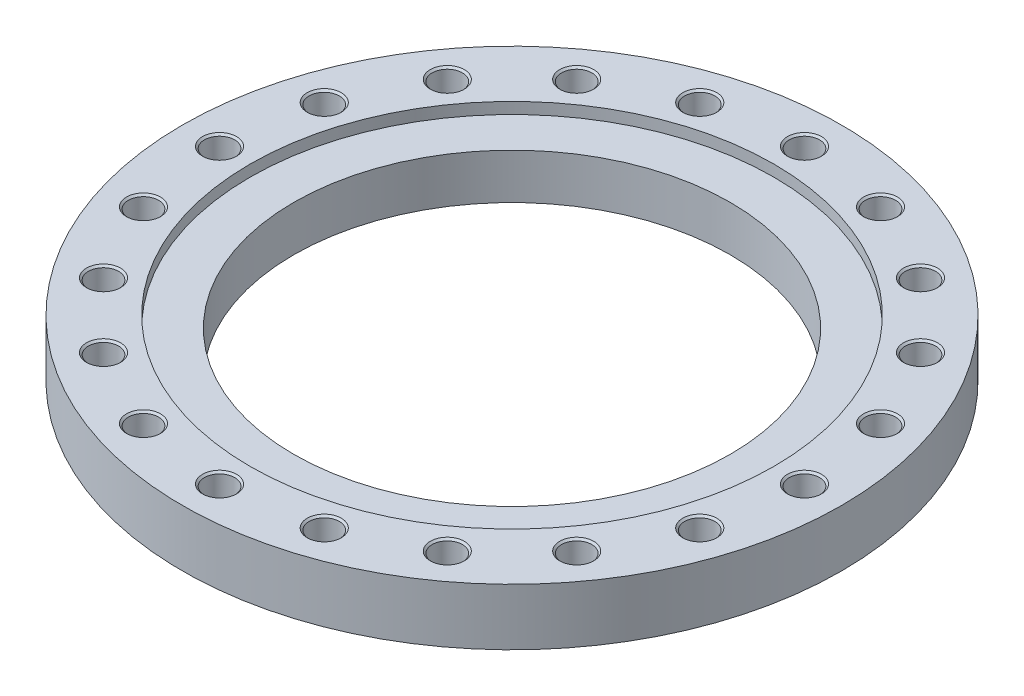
ISO-10303-21;
HEADER;
FILE_DESCRIPTION(('STEP AP214'),'2;1');
FILE_NAME('part.step','',(''),(''),'','','');
FILE_SCHEMA(('AUTOMOTIVE_DESIGN { 1 0 10303 214 1 1 1 1 }'));
ENDSEC;
DATA;
#1=APPLICATION_CONTEXT('core data for automotive mechanical design processes');
#2=APPLICATION_PROTOCOL_DEFINITION('international standard','automotive_design',2000,#1);
#3=PRODUCT_CONTEXT('',#1,'mechanical');
#4=PRODUCT('Part','Part','',(#3));
#5=PRODUCT_RELATED_PRODUCT_CATEGORY('part','',(#4));
#6=PRODUCT_DEFINITION_FORMATION('','',#4);
#7=PRODUCT_DEFINITION_CONTEXT('part definition',#1,'design');
#8=PRODUCT_DEFINITION('design','',#6,#7);
#9=PRODUCT_DEFINITION_SHAPE('','',#8);
#10=(LENGTH_UNIT() NAMED_UNIT(*) SI_UNIT(.MILLI.,.METRE.));
#11=(NAMED_UNIT(*) PLANE_ANGLE_UNIT() SI_UNIT($,.RADIAN.));
#12=(NAMED_UNIT(*) SI_UNIT($,.STERADIAN.) SOLID_ANGLE_UNIT());
#13=UNCERTAINTY_MEASURE_WITH_UNIT(LENGTH_MEASURE(1.E-05),#10,'distance_accuracy_value','');
#14=(GEOMETRIC_REPRESENTATION_CONTEXT(3) GLOBAL_UNCERTAINTY_ASSIGNED_CONTEXT((#13)) GLOBAL_UNIT_ASSIGNED_CONTEXT((#10,
#11,#12)) REPRESENTATION_CONTEXT('',''));
#15=CARTESIAN_POINT('',(0.,0.,0.));
#16=DIRECTION('',(0.,0.,1.));
#17=DIRECTION('',(1.,0.,0.));
#18=AXIS2_PLACEMENT_3D('',#15,#16,#17);
#19=CARTESIAN_POINT('',(0.,32.5,0.));
#20=DIRECTION('',(0.,-1.,0.));
#21=DIRECTION('',(1.,0.,0.));
#22=AXIS2_PLACEMENT_3D('',#19,#20,#21);
#23=CYLINDRICAL_SURFACE('',#22,377.5);
#24=CARTESIAN_POINT('',(0.,0.,0.));
#25=DIRECTION('',(0.,1.,0.));
#26=DIRECTION('',(1.,0.,0.));
#27=AXIS2_PLACEMENT_3D('',#24,#25,#26);
#28=CIRCLE('',#27,377.5);
#29=CARTESIAN_POINT('',(377.5,0.,0.));
#30=VERTEX_POINT('',#29);
#31=EDGE_CURVE('E9',#30,#30,#28,.T.);
#32=ORIENTED_EDGE('',*,*,#31,.T.);
#33=EDGE_LOOP('',(#32));
#34=FACE_BOUND('',#33,.T.);
#35=CARTESIAN_POINT('',(0.,65.,0.));
#36=DIRECTION('',(0.,1.,0.));
#37=DIRECTION('',(1.,0.,0.));
#38=AXIS2_PLACEMENT_3D('',#35,#36,#37);
#39=CIRCLE('',#38,377.5);
#40=CARTESIAN_POINT('',(377.5,65.,0.));
#41=VERTEX_POINT('',#40);
#42=EDGE_CURVE('E626',#41,#41,#39,.T.);
#43=ORIENTED_EDGE('',*,*,#42,.F.);
#44=EDGE_LOOP('',(#43));
#45=FACE_BOUND('',#44,.T.);
#46=ADVANCED_FACE('F15',(#34,#45),#23,.T.);
#47=CARTESIAN_POINT('',(313.75,0.,0.));
#48=DIRECTION('',(0.,-1.,0.));
#49=DIRECTION('',(-1.,0.,0.));
#50=AXIS2_PLACEMENT_3D('',#47,#48,#49);
#51=PLANE('',#50);
#52=CARTESIAN_POINT('',(0.,0.,0.));
#53=DIRECTION('',(0.,1.,0.));
#54=DIRECTION('',(1.,0.,0.));
#55=AXIS2_PLACEMENT_3D('',#52,#53,#54);
#56=CIRCLE('',#55,250.);
#57=CARTESIAN_POINT('',(250.,0.,0.));
#58=VERTEX_POINT('',#57);
#59=EDGE_CURVE('E23',#58,#58,#56,.T.);
#60=ORIENTED_EDGE('',*,*,#59,.T.);
#61=EDGE_LOOP('',(#60));
#62=FACE_BOUND('',#61,.T.);
#63=ORIENTED_EDGE('',*,*,#31,.F.);
#64=EDGE_LOOP('',(#63));
#65=FACE_BOUND('',#64,.T.);
#66=ADVANCED_FACE('F738',(#62,#65),#51,.T.);
#67=CARTESIAN_POINT('',(0.,32.5,0.));
#68=DIRECTION('',(0.,-1.,0.));
#69=DIRECTION('',(1.,0.,0.));
#70=AXIS2_PLACEMENT_3D('',#67,#68,#69);
#71=CYLINDRICAL_SURFACE('',#70,250.);
#72=ORIENTED_EDGE('',*,*,#59,.F.);
#73=EDGE_LOOP('',(#72));
#74=FACE_BOUND('',#73,.T.);
#75=CARTESIAN_POINT('',(0.,52.,0.));
#76=DIRECTION('',(0.,1.,0.));
#77=DIRECTION('',(1.,0.,0.));
#78=AXIS2_PLACEMENT_3D('',#75,#76,#77);
#79=CIRCLE('',#78,250.);
#80=CARTESIAN_POINT('',(-250.,52.,0.));
#81=VERTEX_POINT('',#80);
#82=EDGE_CURVE('E18',#81,#81,#79,.T.);
#83=ORIENTED_EDGE('',*,*,#82,.T.);
#84=EDGE_LOOP('',(#83));
#85=FACE_BOUND('',#84,.T.);
#86=ADVANCED_FACE('F742',(#74,#85),#71,.F.);
#87=CARTESIAN_POINT('',(313.75,65.,0.));
#88=DIRECTION('',(0.,1.,0.));
#89=DIRECTION('',(1.,0.,0.));
#90=AXIS2_PLACEMENT_3D('',#87,#88,#89);
#91=PLANE('',#90);
#92=ORIENTED_EDGE('',*,*,#42,.T.);
#93=EDGE_LOOP('',(#92));
#94=FACE_BOUND('',#93,.T.);
#95=CARTESIAN_POINT('',(0.,65.,0.));
#96=DIRECTION('',(0.,-1.,0.));
#97=DIRECTION('',(1.,0.,0.));
#98=AXIS2_PLACEMENT_3D('',#95,#96,#97);
#99=CIRCLE('',#98,300.);
#100=CARTESIAN_POINT('',(-300.,65.,0.));
#101=VERTEX_POINT('',#100);
#102=EDGE_CURVE('E498',#101,#101,#99,.T.);
#103=ORIENTED_EDGE('',*,*,#102,.T.);
#104=EDGE_LOOP('',(#103));
#105=FACE_BOUND('',#104,.T.);
#106=CARTESIAN_POINT('',(335.,65.,0.));
#107=DIRECTION('',(0.,-1.,0.));
#108=DIRECTION('',(1.,0.,0.));
#109=AXIS2_PLACEMENT_3D('',#106,#107,#108);
#110=CIRCLE('',#109,19.5);
#111=CARTESIAN_POINT('',(354.5,65.,0.));
#112=VERTEX_POINT('',#111);
#113=EDGE_CURVE('E491',#112,#112,#110,.T.);
#114=ORIENTED_EDGE('',*,*,#113,.T.);
#115=EDGE_LOOP('',(#114));
#116=FACE_BOUND('',#115,.T.);
#117=CARTESIAN_POINT('',(318.603932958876,65.,-103.520693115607));
#118=DIRECTION('',(0.,-1.,0.));
#119=DIRECTION('',(0.951056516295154,0.,-0.309016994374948));
#120=AXIS2_PLACEMENT_3D('',#117,#118,#119);
#121=CIRCLE('',#120,19.5);
#122=CARTESIAN_POINT('',(337.149535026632,65.,-109.546524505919));
#123=VERTEX_POINT('',#122);
#124=EDGE_CURVE('E471',#123,#123,#121,.T.);
#125=ORIENTED_EDGE('',*,*,#124,.T.);
#126=EDGE_LOOP('',(#125));
#127=FACE_BOUND('',#126,.T.);
#128=CARTESIAN_POINT('',(271.020693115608,65.,-196.908059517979));
#129=DIRECTION('',(0.,-1.,0.));
#130=DIRECTION('',(0.809016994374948,0.,-0.587785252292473));
#131=AXIS2_PLACEMENT_3D('',#128,#129,#130);
#132=CIRCLE('',#131,19.5);
#133=CARTESIAN_POINT('',(286.796524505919,65.,-208.369871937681));
#134=VERTEX_POINT('',#133);
#135=EDGE_CURVE('E486',#134,#134,#132,.T.);
#136=ORIENTED_EDGE('',*,*,#135,.T.);
#137=EDGE_LOOP('',(#136));
#138=FACE_BOUND('',#137,.T.);
#139=CARTESIAN_POINT('',(196.908059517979,65.,-271.020693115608));
#140=DIRECTION('',(0.,-1.,0.));
#141=DIRECTION('',(0.587785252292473,0.,-0.809016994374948));
#142=AXIS2_PLACEMENT_3D('',#139,#140,#141);
#143=CIRCLE('',#142,19.5);
#144=CARTESIAN_POINT('',(208.369871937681,65.,-286.796524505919));
#145=VERTEX_POINT('',#144);
#146=EDGE_CURVE('E661',#145,#145,#143,.T.);
#147=ORIENTED_EDGE('',*,*,#146,.T.);
#148=EDGE_LOOP('',(#147));
#149=FACE_BOUND('',#148,.T.);
#150=CARTESIAN_POINT('',(103.520693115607,65.,-318.603932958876));
#151=DIRECTION('',(0.,-1.,0.));
#152=DIRECTION('',(0.309016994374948,0.,-0.951056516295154));
#153=AXIS2_PLACEMENT_3D('',#150,#151,#152);
#154=CIRCLE('',#153,19.5);
#155=CARTESIAN_POINT('',(109.546524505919,65.,-337.149535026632));
#156=VERTEX_POINT('',#155);
#157=EDGE_CURVE('E598',#156,#156,#154,.T.);
#158=ORIENTED_EDGE('',*,*,#157,.T.);
#159=EDGE_LOOP('',(#158));
#160=FACE_BOUND('',#159,.T.);
#161=CARTESIAN_POINT('',(0.,65.,-335.));
#162=DIRECTION('',(0.,-1.,0.));
#163=DIRECTION('',(0.,0.,-1.));
#164=AXIS2_PLACEMENT_3D('',#161,#162,#163);
#165=CIRCLE('',#164,19.5);
#166=CARTESIAN_POINT('',(0.,65.,-354.5));
#167=VERTEX_POINT('',#166);
#168=EDGE_CURVE('E559',#167,#167,#165,.T.);
#169=ORIENTED_EDGE('',*,*,#168,.T.);
#170=EDGE_LOOP('',(#169));
#171=FACE_BOUND('',#170,.T.);
#172=CARTESIAN_POINT('',(-103.520693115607,65.,-318.603932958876));
#173=DIRECTION('',(0.,-1.,0.));
#174=DIRECTION('',(-0.309016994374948,0.,-0.951056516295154));
#175=AXIS2_PLACEMENT_3D('',#172,#173,#174);
#176=CIRCLE('',#175,19.5);
#177=CARTESIAN_POINT('',(-109.546524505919,65.,-337.149535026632));
#178=VERTEX_POINT('',#177);
#179=EDGE_CURVE('E607',#178,#178,#176,.T.);
#180=ORIENTED_EDGE('',*,*,#179,.T.);
#181=EDGE_LOOP('',(#180));
#182=FACE_BOUND('',#181,.T.);
#183=CARTESIAN_POINT('',(-196.908059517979,65.,-271.020693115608));
#184=DIRECTION('',(0.,-1.,0.));
#185=DIRECTION('',(-0.587785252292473,0.,-0.809016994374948));
#186=AXIS2_PLACEMENT_3D('',#183,#184,#185);
#187=CIRCLE('',#186,19.5);
#188=CARTESIAN_POINT('',(-208.369871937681,65.,-286.796524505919));
#189=VERTEX_POINT('',#188);
#190=EDGE_CURVE('E675',#189,#189,#187,.T.);
#191=ORIENTED_EDGE('',*,*,#190,.T.);
#192=EDGE_LOOP('',(#191));
#193=FACE_BOUND('',#192,.T.);
#194=CARTESIAN_POINT('',(-271.020693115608,65.,-196.908059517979));
#195=DIRECTION('',(0.,-1.,0.));
#196=DIRECTION('',(-0.809016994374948,0.,-0.587785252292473));
#197=AXIS2_PLACEMENT_3D('',#194,#195,#196);
#198=CIRCLE('',#197,19.5);
#199=CARTESIAN_POINT('',(-286.796524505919,65.,-208.369871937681));
#200=VERTEX_POINT('',#199);
#201=EDGE_CURVE('E695',#200,#200,#198,.T.);
#202=ORIENTED_EDGE('',*,*,#201,.T.);
#203=EDGE_LOOP('',(#202));
#204=FACE_BOUND('',#203,.T.);
#205=CARTESIAN_POINT('',(-318.603932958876,65.,-103.520693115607));
#206=DIRECTION('',(0.,-1.,0.));
#207=DIRECTION('',(-0.951056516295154,0.,-0.309016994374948));
#208=AXIS2_PLACEMENT_3D('',#205,#206,#207);
#209=CIRCLE('',#208,19.5);
#210=CARTESIAN_POINT('',(-337.149535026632,65.,-109.546524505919));
#211=VERTEX_POINT('',#210);
#212=EDGE_CURVE('E619',#211,#211,#209,.T.);
#213=ORIENTED_EDGE('',*,*,#212,.T.);
#214=EDGE_LOOP('',(#213));
#215=FACE_BOUND('',#214,.T.);
#216=CARTESIAN_POINT('',(-335.,65.,0.));
#217=DIRECTION('',(0.,-1.,0.));
#218=DIRECTION('',(-1.,0.,0.));
#219=AXIS2_PLACEMENT_3D('',#216,#217,#218);
#220=CIRCLE('',#219,19.5);
#221=CARTESIAN_POINT('',(-354.5,65.,0.));
#222=VERTEX_POINT('',#221);
#223=EDGE_CURVE('E544',#222,#222,#220,.T.);
#224=ORIENTED_EDGE('',*,*,#223,.T.);
#225=EDGE_LOOP('',(#224));
#226=FACE_BOUND('',#225,.T.);
#227=CARTESIAN_POINT('',(-318.603932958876,65.,103.520693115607));
#228=DIRECTION('',(0.,-1.,0.));
#229=DIRECTION('',(-0.951056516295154,0.,0.309016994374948));
#230=AXIS2_PLACEMENT_3D('',#227,#228,#229);
#231=CIRCLE('',#230,19.5);
#232=CARTESIAN_POINT('',(-337.149535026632,65.,109.546524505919));
#233=VERTEX_POINT('',#232);
#234=EDGE_CURVE('E629',#233,#233,#231,.T.);
#235=ORIENTED_EDGE('',*,*,#234,.T.);
#236=EDGE_LOOP('',(#235));
#237=FACE_BOUND('',#236,.T.);
#238=CARTESIAN_POINT('',(-271.020693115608,65.,196.908059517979));
#239=DIRECTION('',(0.,-1.,0.));
#240=DIRECTION('',(-0.809016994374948,0.,0.587785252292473));
#241=AXIS2_PLACEMENT_3D('',#238,#239,#240);
#242=CIRCLE('',#241,19.5);
#243=CARTESIAN_POINT('',(-286.796524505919,65.,208.369871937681));
#244=VERTEX_POINT('',#243);
#245=EDGE_CURVE('E610',#244,#244,#242,.T.);
#246=ORIENTED_EDGE('',*,*,#245,.T.);
#247=EDGE_LOOP('',(#246));
#248=FACE_BOUND('',#247,.T.);
#249=CARTESIAN_POINT('',(-196.908059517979,65.,271.020693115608));
#250=DIRECTION('',(0.,-1.,0.));
#251=DIRECTION('',(-0.587785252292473,0.,0.809016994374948));
#252=AXIS2_PLACEMENT_3D('',#249,#250,#251);
#253=CIRCLE('',#252,19.5);
#254=CARTESIAN_POINT('',(-208.369871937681,65.,286.796524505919));
#255=VERTEX_POINT('',#254);
#256=EDGE_CURVE('E649',#255,#255,#253,.T.);
#257=ORIENTED_EDGE('',*,*,#256,.T.);
#258=EDGE_LOOP('',(#257));
#259=FACE_BOUND('',#258,.T.);
#260=CARTESIAN_POINT('',(-103.520693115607,65.,318.603932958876));
#261=DIRECTION('',(0.,-1.,0.));
#262=DIRECTION('',(-0.309016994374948,0.,0.951056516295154));
#263=AXIS2_PLACEMENT_3D('',#260,#261,#262);
#264=CIRCLE('',#263,19.5);
#265=CARTESIAN_POINT('',(-109.546524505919,65.,337.149535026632));
#266=VERTEX_POINT('',#265);
#267=EDGE_CURVE('E635',#266,#266,#264,.T.);
#268=ORIENTED_EDGE('',*,*,#267,.T.);
#269=EDGE_LOOP('',(#268));
#270=FACE_BOUND('',#269,.T.);
#271=CARTESIAN_POINT('',(0.,65.,335.));
#272=DIRECTION('',(0.,-1.,0.));
#273=DIRECTION('',(0.,0.,1.));
#274=AXIS2_PLACEMENT_3D('',#271,#272,#273);
#275=CIRCLE('',#274,19.5);
#276=CARTESIAN_POINT('',(0.,65.,354.5));
#277=VERTEX_POINT('',#276);
#278=EDGE_CURVE('E604',#277,#277,#275,.T.);
#279=ORIENTED_EDGE('',*,*,#278,.T.);
#280=EDGE_LOOP('',(#279));
#281=FACE_BOUND('',#280,.T.);
#282=CARTESIAN_POINT('',(103.520693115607,65.,318.603932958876));
#283=DIRECTION('',(0.,-1.,0.));
#284=DIRECTION('',(0.309016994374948,0.,0.951056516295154));
#285=AXIS2_PLACEMENT_3D('',#282,#283,#284);
#286=CIRCLE('',#285,19.5);
#287=CARTESIAN_POINT('',(109.546524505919,65.,337.149535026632));
#288=VERTEX_POINT('',#287);
#289=EDGE_CURVE('E585',#288,#288,#286,.T.);
#290=ORIENTED_EDGE('',*,*,#289,.T.);
#291=EDGE_LOOP('',(#290));
#292=FACE_BOUND('',#291,.T.);
#293=CARTESIAN_POINT('',(196.908059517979,65.,271.020693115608));
#294=DIRECTION('',(0.,-1.,0.));
#295=DIRECTION('',(0.587785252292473,0.,0.809016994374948));
#296=AXIS2_PLACEMENT_3D('',#293,#294,#295);
#297=CIRCLE('',#296,19.5);
#298=CARTESIAN_POINT('',(208.369871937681,65.,286.796524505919));
#299=VERTEX_POINT('',#298);
#300=EDGE_CURVE('E521',#299,#299,#297,.T.);
#301=ORIENTED_EDGE('',*,*,#300,.T.);
#302=EDGE_LOOP('',(#301));
#303=FACE_BOUND('',#302,.T.);
#304=CARTESIAN_POINT('',(271.020693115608,65.,196.908059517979));
#305=DIRECTION('',(0.,-1.,0.));
#306=DIRECTION('',(0.809016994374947,0.,0.587785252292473));
#307=AXIS2_PLACEMENT_3D('',#304,#305,#306);
#308=CIRCLE('',#307,19.5);
#309=CARTESIAN_POINT('',(286.796524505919,65.,208.369871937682));
#310=VERTEX_POINT('',#309);
#311=EDGE_CURVE('E530',#310,#310,#308,.T.);
#312=ORIENTED_EDGE('',*,*,#311,.T.);
#313=EDGE_LOOP('',(#312));
#314=FACE_BOUND('',#313,.T.);
#315=CARTESIAN_POINT('',(318.603932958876,65.,103.520693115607));
#316=DIRECTION('',(0.,-1.,0.));
#317=DIRECTION('',(0.951056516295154,0.,0.309016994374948));
#318=AXIS2_PLACEMENT_3D('',#315,#316,#317);
#319=CIRCLE('',#318,19.5);
#320=CARTESIAN_POINT('',(337.149535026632,65.,109.546524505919));
#321=VERTEX_POINT('',#320);
#322=EDGE_CURVE('E514',#321,#321,#319,.T.);
#323=ORIENTED_EDGE('',*,*,#322,.T.);
#324=EDGE_LOOP('',(#323));
#325=FACE_BOUND('',#324,.T.);
#326=ADVANCED_FACE('F746',(#94,#105,#116,#127,#138,#149,#160,#171,#182,#193,#204,#215,#226,#237,
#248,#259,#270,#281,#292,#303,#314,#325),#91,.T.);
#327=CARTESIAN_POINT('',(0.,52.,0.));
#328=DIRECTION('',(0.,-1.,0.));
#329=DIRECTION('',(-1.,0.,0.));
#330=AXIS2_PLACEMENT_3D('',#327,#328,#329);
#331=PLANE('',#330);
#332=CARTESIAN_POINT('',(0.,52.,0.));
#333=DIRECTION('',(0.,-1.,0.));
#334=DIRECTION('',(1.,0.,0.));
#335=AXIS2_PLACEMENT_3D('',#332,#333,#334);
#336=CIRCLE('',#335,300.);
#337=CARTESIAN_POINT('',(300.,52.,0.));
#338=VERTEX_POINT('',#337);
#339=EDGE_CURVE('E501',#338,#338,#336,.T.);
#340=ORIENTED_EDGE('',*,*,#339,.F.);
#341=EDGE_LOOP('',(#340));
#342=FACE_BOUND('',#341,.T.);
#343=ORIENTED_EDGE('',*,*,#82,.F.);
#344=EDGE_LOOP('',(#343));
#345=FACE_BOUND('',#344,.T.);
#346=ADVANCED_FACE('F749',(#342,#345),#331,.F.);
#347=CARTESIAN_POINT('',(0.,61.75,0.));
#348=DIRECTION('',(0.,-1.,0.));
#349=DIRECTION('',(1.,0.,0.));
#350=AXIS2_PLACEMENT_3D('',#347,#348,#349);
#351=CYLINDRICAL_SURFACE('',#350,300.);
#352=ORIENTED_EDGE('',*,*,#339,.T.);
#353=EDGE_LOOP('',(#352));
#354=FACE_BOUND('',#353,.T.);
#355=ORIENTED_EDGE('',*,*,#102,.F.);
#356=EDGE_LOOP('',(#355));
#357=FACE_BOUND('',#356,.T.);
#358=ADVANCED_FACE('F1291',(#354,#357),#351,.F.);
#359=CARTESIAN_POINT('',(335.,9.99581654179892,0.));
#360=DIRECTION('',(0.,1.,0.));
#361=DIRECTION('',(1.,0.,0.));
#362=AXIS2_PLACEMENT_3D('',#359,#360,#361);
#363=CONICAL_SURFACE('',#362,8.6675,1.0471975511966);
#364=CARTESIAN_POINT('',(335.,15.,0.));
#365=DIRECTION('',(0.,-1.,0.));
#366=DIRECTION('',(1.,0.,0.));
#367=AXIS2_PLACEMENT_3D('',#364,#365,#366);
#368=CIRCLE('',#367,17.335);
#369=CARTESIAN_POINT('',(352.335,15.,0.));
#370=VERTEX_POINT('',#369);
#371=EDGE_CURVE('E497',#370,#370,#368,.T.);
#372=ORIENTED_EDGE('',*,*,#371,.F.);
#373=EDGE_LOOP('',(#372));
#374=FACE_BOUND('',#373,.T.);
#375=CARTESIAN_POINT('',(335.,4.99163308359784,0.));
#376=VERTEX_POINT('',#375);
#377=VERTEX_LOOP('',#376);
#378=FACE_BOUND('',#377,.T.);
#379=ADVANCED_FACE('F1294',(#374,#378),#363,.F.);
#380=CARTESIAN_POINT('',(335.,19.9175,0.));
#381=DIRECTION('',(0.,1.,0.));
#382=DIRECTION('',(1.,0.,0.));
#383=AXIS2_PLACEMENT_3D('',#380,#381,#382);
#384=CYLINDRICAL_SURFACE('',#383,17.335);
#385=CARTESIAN_POINT('',(335.,24.835,0.));
#386=DIRECTION('',(0.,-1.,0.));
#387=DIRECTION('',(1.,0.,0.));
#388=AXIS2_PLACEMENT_3D('',#385,#386,#387);
#389=CIRCLE('',#388,17.335);
#390=CARTESIAN_POINT('',(352.335,24.835,0.));
#391=VERTEX_POINT('',#390);
#392=EDGE_CURVE('E496',#391,#391,#389,.T.);
#393=ORIENTED_EDGE('',*,*,#392,.F.);
#394=EDGE_LOOP('',(#393));
#395=FACE_BOUND('',#394,.T.);
#396=ORIENTED_EDGE('',*,*,#371,.T.);
#397=EDGE_LOOP('',(#396));
#398=FACE_BOUND('',#397,.T.);
#399=ADVANCED_FACE('F1963',(#395,#398),#384,.F.);
#400=CARTESIAN_POINT('',(335.,25.9175,0.));
#401=DIRECTION('',(0.,1.,0.));
#402=DIRECTION('',(1.,0.,0.));
#403=AXIS2_PLACEMENT_3D('',#400,#401,#402);
#404=CONICAL_SURFACE('',#403,18.4175,0.785398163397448);
#405=CARTESIAN_POINT('',(335.,27.,0.));
#406=DIRECTION('',(0.,-1.,0.));
#407=DIRECTION('',(1.,0.,0.));
#408=AXIS2_PLACEMENT_3D('',#405,#406,#407);
#409=CIRCLE('',#408,19.5);
#410=CARTESIAN_POINT('',(354.5,27.,0.));
#411=VERTEX_POINT('',#410);
#412=EDGE_CURVE('E495',#411,#411,#409,.T.);
#413=ORIENTED_EDGE('',*,*,#412,.F.);
#414=EDGE_LOOP('',(#413));
#415=FACE_BOUND('',#414,.T.);
#416=ORIENTED_EDGE('',*,*,#392,.T.);
#417=EDGE_LOOP('',(#416));
#418=FACE_BOUND('',#417,.T.);
#419=ADVANCED_FACE('F1253',(#415,#418),#404,.F.);
#420=CARTESIAN_POINT('',(353.4175,27.,0.));
#421=DIRECTION('',(0.,1.,0.));
#422=DIRECTION('',(-1.,0.,0.));
#423=AXIS2_PLACEMENT_3D('',#420,#421,#422);
#424=PLANE('',#423);
#425=CARTESIAN_POINT('',(335.,27.,0.));
#426=DIRECTION('',(0.,-1.,0.));
#427=DIRECTION('',(1.,0.,0.));
#428=AXIS2_PLACEMENT_3D('',#425,#426,#427);
#429=CIRCLE('',#428,17.335);
#430=CARTESIAN_POINT('',(352.335,27.,0.));
#431=VERTEX_POINT('',#430);
#432=EDGE_CURVE('E494',#431,#431,#429,.T.);
#433=ORIENTED_EDGE('',*,*,#432,.F.);
#434=EDGE_LOOP('',(#433));
#435=FACE_BOUND('',#434,.T.);
#436=ORIENTED_EDGE('',*,*,#412,.T.);
#437=EDGE_LOOP('',(#436));
#438=FACE_BOUND('',#437,.T.);
#439=ADVANCED_FACE('F1204',(#435,#438),#424,.F.);
#440=CARTESIAN_POINT('',(335.,44.9175,0.));
#441=DIRECTION('',(0.,1.,0.));
#442=DIRECTION('',(1.,0.,0.));
#443=AXIS2_PLACEMENT_3D('',#440,#441,#442);
#444=CYLINDRICAL_SURFACE('',#443,17.335);
#445=CARTESIAN_POINT('',(335.,62.835,0.));
#446=DIRECTION('',(0.,-1.,0.));
#447=DIRECTION('',(1.,0.,0.));
#448=AXIS2_PLACEMENT_3D('',#445,#446,#447);
#449=CIRCLE('',#448,17.335);
#450=CARTESIAN_POINT('',(352.335,62.835,0.));
#451=VERTEX_POINT('',#450);
#452=EDGE_CURVE('E489',#451,#451,#449,.T.);
#453=ORIENTED_EDGE('',*,*,#452,.F.);
#454=EDGE_LOOP('',(#453));
#455=FACE_BOUND('',#454,.T.);
#456=ORIENTED_EDGE('',*,*,#432,.T.);
#457=EDGE_LOOP('',(#456));
#458=FACE_BOUND('',#457,.T.);
#459=ADVANCED_FACE('F1198',(#455,#458),#444,.F.);
#460=CARTESIAN_POINT('',(335.,63.9175,0.));
#461=DIRECTION('',(0.,1.,0.));
#462=DIRECTION('',(1.,0.,0.));
#463=AXIS2_PLACEMENT_3D('',#460,#461,#462);
#464=CONICAL_SURFACE('',#463,18.4175,0.785398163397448);
#465=ORIENTED_EDGE('',*,*,#113,.F.);
#466=EDGE_LOOP('',(#465));
#467=FACE_BOUND('',#466,.T.);
#468=ORIENTED_EDGE('',*,*,#452,.T.);
#469=EDGE_LOOP('',(#468));
#470=FACE_BOUND('',#469,.T.);
#471=ADVANCED_FACE('F1194',(#467,#470),#464,.F.);
#472=CARTESIAN_POINT('',(318.603932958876,9.99581654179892,-103.520693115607));
#473=DIRECTION('',(0.,1.,0.));
#474=DIRECTION('',(0.951056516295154,0.,-0.309016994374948));
#475=AXIS2_PLACEMENT_3D('',#472,#473,#474);
#476=CONICAL_SURFACE('',#475,8.6675,1.0471975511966);
#477=CARTESIAN_POINT('',(318.603932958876,15.,-103.520693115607));
#478=DIRECTION('',(0.,-1.,0.));
#479=DIRECTION('',(0.951056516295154,0.,-0.309016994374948));
#480=AXIS2_PLACEMENT_3D('',#477,#478,#479);
#481=CIRCLE('',#480,17.335);
#482=CARTESIAN_POINT('',(335.090497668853,15.,-108.877502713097));
#483=VERTEX_POINT('',#482);
#484=EDGE_CURVE('E492',#483,#483,#481,.T.);
#485=ORIENTED_EDGE('',*,*,#484,.F.);
#486=EDGE_LOOP('',(#485));
#487=FACE_BOUND('',#486,.T.);
#488=CARTESIAN_POINT('',(318.603932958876,4.99163308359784,-103.520693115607));
#489=VERTEX_POINT('',#488);
#490=VERTEX_LOOP('',#489);
#491=FACE_BOUND('',#490,.T.);
#492=ADVANCED_FACE('F862',(#487,#491),#476,.F.);
#493=CARTESIAN_POINT('',(318.603932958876,19.9175,-103.520693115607));
#494=DIRECTION('',(0.,1.,0.));
#495=DIRECTION('',(0.951056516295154,0.,-0.309016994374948));
#496=AXIS2_PLACEMENT_3D('',#493,#494,#495);
#497=CYLINDRICAL_SURFACE('',#496,17.335);
#498=CARTESIAN_POINT('',(318.603932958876,24.835,-103.520693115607));
#499=DIRECTION('',(0.,-1.,0.));
#500=DIRECTION('',(0.951056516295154,0.,-0.309016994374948));
#501=AXIS2_PLACEMENT_3D('',#498,#499,#500);
#502=CIRCLE('',#501,17.335);
#503=CARTESIAN_POINT('',(335.090497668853,24.835,-108.877502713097));
#504=VERTEX_POINT('',#503);
#505=EDGE_CURVE('E519',#504,#504,#502,.T.);
#506=ORIENTED_EDGE('',*,*,#505,.F.);
#507=EDGE_LOOP('',(#506));
#508=FACE_BOUND('',#507,.T.);
#509=ORIENTED_EDGE('',*,*,#484,.T.);
#510=EDGE_LOOP('',(#509));
#511=FACE_BOUND('',#510,.T.);
#512=ADVANCED_FACE('F1179',(#508,#511),#497,.F.);
#513=CARTESIAN_POINT('',(318.603932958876,25.9175,-103.520693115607));
#514=DIRECTION('',(0.,1.,0.));
#515=DIRECTION('',(0.951056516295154,0.,-0.309016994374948));
#516=AXIS2_PLACEMENT_3D('',#513,#514,#515);
#517=CONICAL_SURFACE('',#516,18.4175,0.785398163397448);
#518=CARTESIAN_POINT('',(318.603932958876,27.,-103.520693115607));
#519=DIRECTION('',(0.,-1.,0.));
#520=DIRECTION('',(0.951056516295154,0.,-0.309016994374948));
#521=AXIS2_PLACEMENT_3D('',#518,#519,#520);
#522=CIRCLE('',#521,19.5);
#523=CARTESIAN_POINT('',(337.149535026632,27.,-109.546524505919));
#524=VERTEX_POINT('',#523);
#525=EDGE_CURVE('E517',#524,#524,#522,.T.);
#526=ORIENTED_EDGE('',*,*,#525,.F.);
#527=EDGE_LOOP('',(#526));
#528=FACE_BOUND('',#527,.T.);
#529=ORIENTED_EDGE('',*,*,#505,.T.);
#530=EDGE_LOOP('',(#529));
#531=FACE_BOUND('',#530,.T.);
#532=ADVANCED_FACE('F1038',(#528,#531),#517,.F.);
#533=CARTESIAN_POINT('',(336.120016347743,27.,-109.212013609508));
#534=DIRECTION('',(0.,1.,0.));
#535=DIRECTION('',(-0.951056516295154,0.,0.309016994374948));
#536=AXIS2_PLACEMENT_3D('',#533,#534,#535);
#537=PLANE('',#536);
#538=CARTESIAN_POINT('',(318.603932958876,27.,-103.520693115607));
#539=DIRECTION('',(0.,-1.,0.));
#540=DIRECTION('',(0.951056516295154,0.,-0.309016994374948));
#541=AXIS2_PLACEMENT_3D('',#538,#539,#540);
#542=CIRCLE('',#541,17.335);
#543=CARTESIAN_POINT('',(335.090497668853,27.,-108.877502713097));
#544=VERTEX_POINT('',#543);
#545=EDGE_CURVE('E520',#544,#544,#542,.T.);
#546=ORIENTED_EDGE('',*,*,#545,.F.);
#547=EDGE_LOOP('',(#546));
#548=FACE_BOUND('',#547,.T.);
#549=ORIENTED_EDGE('',*,*,#525,.T.);
#550=EDGE_LOOP('',(#549));
#551=FACE_BOUND('',#550,.T.);
#552=ADVANCED_FACE('F1035',(#548,#551),#537,.F.);
#553=CARTESIAN_POINT('',(318.603932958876,44.9175,-103.520693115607));
#554=DIRECTION('',(0.,1.,0.));
#555=DIRECTION('',(0.951056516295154,0.,-0.309016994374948));
#556=AXIS2_PLACEMENT_3D('',#553,#554,#555);
#557=CYLINDRICAL_SURFACE('',#556,17.335);
#558=CARTESIAN_POINT('',(318.603932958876,62.835,-103.520693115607));
#559=DIRECTION('',(0.,-1.,0.));
#560=DIRECTION('',(0.951056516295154,0.,-0.309016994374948));
#561=AXIS2_PLACEMENT_3D('',#558,#559,#560);
#562=CIRCLE('',#561,17.335);
#563=CARTESIAN_POINT('',(335.090497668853,62.835,-108.877502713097));
#564=VERTEX_POINT('',#563);
#565=EDGE_CURVE('E468',#564,#564,#562,.T.);
#566=ORIENTED_EDGE('',*,*,#565,.F.);
#567=EDGE_LOOP('',(#566));
#568=FACE_BOUND('',#567,.T.);
#569=ORIENTED_EDGE('',*,*,#545,.T.);
#570=EDGE_LOOP('',(#569));
#571=FACE_BOUND('',#570,.T.);
#572=ADVANCED_FACE('F992',(#568,#571),#557,.F.);
#573=CARTESIAN_POINT('',(318.603932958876,63.9175,-103.520693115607));
#574=DIRECTION('',(0.,1.,0.));
#575=DIRECTION('',(0.951056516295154,0.,-0.309016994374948));
#576=AXIS2_PLACEMENT_3D('',#573,#574,#575);
#577=CONICAL_SURFACE('',#576,18.4175,0.785398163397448);
#578=ORIENTED_EDGE('',*,*,#124,.F.);
#579=EDGE_LOOP('',(#578));
#580=FACE_BOUND('',#579,.T.);
#581=ORIENTED_EDGE('',*,*,#565,.T.);
#582=EDGE_LOOP('',(#581));
#583=FACE_BOUND('',#582,.T.);
#584=ADVANCED_FACE('F989',(#580,#583),#577,.F.);
#585=CARTESIAN_POINT('',(271.020693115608,9.99581654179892,-196.908059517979));
#586=DIRECTION('',(0.,1.,0.));
#587=DIRECTION('',(0.809016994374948,0.,-0.587785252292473));
#588=AXIS2_PLACEMENT_3D('',#585,#586,#587);
#589=CONICAL_SURFACE('',#588,8.6675,1.0471975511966);
#590=CARTESIAN_POINT('',(271.020693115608,15.,-196.908059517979));
#591=DIRECTION('',(0.,-1.,0.));
#592=DIRECTION('',(0.809016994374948,0.,-0.587785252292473));
#593=AXIS2_PLACEMENT_3D('',#590,#591,#592);
#594=CIRCLE('',#593,17.335);
#595=CARTESIAN_POINT('',(285.045002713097,15.,-207.097316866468));
#596=VERTEX_POINT('',#595);
#597=EDGE_CURVE('E465',#596,#596,#594,.T.);
#598=ORIENTED_EDGE('',*,*,#597,.F.);
#599=EDGE_LOOP('',(#598));
#600=FACE_BOUND('',#599,.T.);
#601=CARTESIAN_POINT('',(271.020693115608,4.99163308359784,-196.908059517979));
#602=VERTEX_POINT('',#601);
#603=VERTEX_LOOP('',#602);
#604=FACE_BOUND('',#603,.T.);
#605=ADVANCED_FACE('F967',(#600,#604),#589,.F.);
#606=CARTESIAN_POINT('',(271.020693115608,19.9175,-196.908059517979));
#607=DIRECTION('',(0.,1.,0.));
#608=DIRECTION('',(0.809016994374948,0.,-0.587785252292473));
#609=AXIS2_PLACEMENT_3D('',#606,#607,#608);
#610=CYLINDRICAL_SURFACE('',#609,17.335);
#611=CARTESIAN_POINT('',(271.020693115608,24.835,-196.908059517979));
#612=DIRECTION('',(0.,-1.,0.));
#613=DIRECTION('',(0.809016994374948,0.,-0.587785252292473));
#614=AXIS2_PLACEMENT_3D('',#611,#612,#613);
#615=CIRCLE('',#614,17.335);
#616=CARTESIAN_POINT('',(285.045002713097,24.835,-207.097316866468));
#617=VERTEX_POINT('',#616);
#618=EDGE_CURVE('E469',#617,#617,#615,.T.);
#619=ORIENTED_EDGE('',*,*,#618,.F.);
#620=EDGE_LOOP('',(#619));
#621=FACE_BOUND('',#620,.T.);
#622=ORIENTED_EDGE('',*,*,#597,.T.);
#623=EDGE_LOOP('',(#622));
#624=FACE_BOUND('',#623,.T.);
#625=ADVANCED_FACE('F466',(#621,#624),#610,.F.);
#626=CARTESIAN_POINT('',(271.020693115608,25.9175,-196.908059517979));
#627=DIRECTION('',(0.,1.,0.));
#628=DIRECTION('',(0.809016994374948,0.,-0.587785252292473));
#629=AXIS2_PLACEMENT_3D('',#626,#627,#628);
#630=CONICAL_SURFACE('',#629,18.4175,0.785398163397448);
#631=CARTESIAN_POINT('',(271.020693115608,27.,-196.908059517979));
#632=DIRECTION('',(0.,-1.,0.));
#633=DIRECTION('',(0.809016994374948,0.,-0.587785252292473));
#634=AXIS2_PLACEMENT_3D('',#631,#632,#633);
#635=CIRCLE('',#634,19.5);
#636=CARTESIAN_POINT('',(286.796524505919,27.,-208.369871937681));
#637=VERTEX_POINT('',#636);
#638=EDGE_CURVE('E473',#637,#637,#635,.T.);
#639=ORIENTED_EDGE('',*,*,#638,.F.);
#640=EDGE_LOOP('',(#639));
#641=FACE_BOUND('',#640,.T.);
#642=ORIENTED_EDGE('',*,*,#618,.T.);
#643=EDGE_LOOP('',(#642));
#644=FACE_BOUND('',#643,.T.);
#645=ADVANCED_FACE('F931',(#641,#644),#630,.F.);
#646=CARTESIAN_POINT('',(285.920763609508,27.,-207.733594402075));
#647=DIRECTION('',(0.,1.,0.));
#648=DIRECTION('',(-0.809016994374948,0.,0.587785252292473));
#649=AXIS2_PLACEMENT_3D('',#646,#647,#648);
#650=PLANE('',#649);
#651=CARTESIAN_POINT('',(271.020693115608,27.,-196.908059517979));
#652=DIRECTION('',(0.,-1.,0.));
#653=DIRECTION('',(0.809016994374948,0.,-0.587785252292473));
#654=AXIS2_PLACEMENT_3D('',#651,#652,#653);
#655=CIRCLE('',#654,17.335);
#656=CARTESIAN_POINT('',(285.045002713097,27.,-207.097316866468));
#657=VERTEX_POINT('',#656);
#658=EDGE_CURVE('E487',#657,#657,#655,.T.);
#659=ORIENTED_EDGE('',*,*,#658,.F.);
#660=EDGE_LOOP('',(#659));
#661=FACE_BOUND('',#660,.T.);
#662=ORIENTED_EDGE('',*,*,#638,.T.);
#663=EDGE_LOOP('',(#662));
#664=FACE_BOUND('',#663,.T.);
#665=ADVANCED_FACE('F934',(#661,#664),#650,.F.);
#666=CARTESIAN_POINT('',(271.020693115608,44.9175,-196.908059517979));
#667=DIRECTION('',(0.,1.,0.));
#668=DIRECTION('',(0.809016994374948,0.,-0.587785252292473));
#669=AXIS2_PLACEMENT_3D('',#666,#667,#668);
#670=CYLINDRICAL_SURFACE('',#669,17.335);
#671=CARTESIAN_POINT('',(271.020693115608,62.835,-196.908059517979));
#672=DIRECTION('',(0.,-1.,0.));
#673=DIRECTION('',(0.809016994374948,0.,-0.587785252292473));
#674=AXIS2_PLACEMENT_3D('',#671,#672,#673);
#675=CIRCLE('',#674,17.335);
#676=CARTESIAN_POINT('',(285.045002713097,62.835,-207.097316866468));
#677=VERTEX_POINT('',#676);
#678=EDGE_CURVE('E484',#677,#677,#675,.T.);
#679=ORIENTED_EDGE('',*,*,#678,.F.);
#680=EDGE_LOOP('',(#679));
#681=FACE_BOUND('',#680,.T.);
#682=ORIENTED_EDGE('',*,*,#658,.T.);
#683=EDGE_LOOP('',(#682));
#684=FACE_BOUND('',#683,.T.);
#685=ADVANCED_FACE('F947',(#681,#684),#670,.F.);
#686=CARTESIAN_POINT('',(271.020693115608,63.9175,-196.908059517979));
#687=DIRECTION('',(0.,1.,0.));
#688=DIRECTION('',(0.809016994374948,0.,-0.587785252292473));
#689=AXIS2_PLACEMENT_3D('',#686,#687,#688);
#690=CONICAL_SURFACE('',#689,18.4175,0.785398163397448);
#691=ORIENTED_EDGE('',*,*,#135,.F.);
#692=EDGE_LOOP('',(#691));
#693=FACE_BOUND('',#692,.T.);
#694=ORIENTED_EDGE('',*,*,#678,.T.);
#695=EDGE_LOOP('',(#694));
#696=FACE_BOUND('',#695,.T.);
#697=ADVANCED_FACE('F1077',(#693,#696),#690,.F.);
#698=CARTESIAN_POINT('',(196.908059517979,9.99581654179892,-271.020693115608));
#699=DIRECTION('',(0.,1.,0.));
#700=DIRECTION('',(0.587785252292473,0.,-0.809016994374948));
#701=AXIS2_PLACEMENT_3D('',#698,#699,#700);
#702=CONICAL_SURFACE('',#701,8.6675,1.0471975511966);
#703=CARTESIAN_POINT('',(196.908059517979,15.,-271.020693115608));
#704=DIRECTION('',(0.,-1.,0.));
#705=DIRECTION('',(0.587785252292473,0.,-0.809016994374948));
#706=AXIS2_PLACEMENT_3D('',#703,#704,#705);
#707=CIRCLE('',#706,17.335);
#708=CARTESIAN_POINT('',(207.097316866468,15.,-285.045002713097));
#709=VERTEX_POINT('',#708);
#710=EDGE_CURVE('E482',#709,#709,#707,.T.);
#711=ORIENTED_EDGE('',*,*,#710,.F.);
#712=EDGE_LOOP('',(#711));
#713=FACE_BOUND('',#712,.T.);
#714=CARTESIAN_POINT('',(196.908059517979,4.99163308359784,-271.020693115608));
#715=VERTEX_POINT('',#714);
#716=VERTEX_LOOP('',#715);
#717=FACE_BOUND('',#716,.T.);
#718=ADVANCED_FACE('F1080',(#713,#717),#702,.F.);
#719=CARTESIAN_POINT('',(196.908059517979,19.9175,-271.020693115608));
#720=DIRECTION('',(0.,1.,0.));
#721=DIRECTION('',(0.587785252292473,0.,-0.809016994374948));
#722=AXIS2_PLACEMENT_3D('',#719,#720,#721);
#723=CYLINDRICAL_SURFACE('',#722,17.335);
#724=CARTESIAN_POINT('',(196.908059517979,24.835,-271.020693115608));
#725=DIRECTION('',(0.,-1.,0.));
#726=DIRECTION('',(0.587785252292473,0.,-0.809016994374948));
#727=AXIS2_PLACEMENT_3D('',#724,#725,#726);
#728=CIRCLE('',#727,17.335);
#729=CARTESIAN_POINT('',(207.097316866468,24.835,-285.045002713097));
#730=VERTEX_POINT('',#729);
#731=EDGE_CURVE('E481',#730,#730,#728,.T.);
#732=ORIENTED_EDGE('',*,*,#731,.F.);
#733=EDGE_LOOP('',(#732));
#734=FACE_BOUND('',#733,.T.);
#735=ORIENTED_EDGE('',*,*,#710,.T.);
#736=EDGE_LOOP('',(#735));
#737=FACE_BOUND('',#736,.T.);
#738=ADVANCED_FACE('F1222',(#734,#737),#723,.F.);
#739=CARTESIAN_POINT('',(196.908059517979,25.9175,-271.020693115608));
#740=DIRECTION('',(0.,1.,0.));
#741=DIRECTION('',(0.587785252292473,0.,-0.809016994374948));
#742=AXIS2_PLACEMENT_3D('',#739,#740,#741);
#743=CONICAL_SURFACE('',#742,18.4175,0.785398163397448);
#744=CARTESIAN_POINT('',(196.908059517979,27.,-271.020693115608));
#745=DIRECTION('',(0.,-1.,0.));
#746=DIRECTION('',(0.587785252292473,0.,-0.809016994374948));
#747=AXIS2_PLACEMENT_3D('',#744,#745,#746);
#748=CIRCLE('',#747,19.5);
#749=CARTESIAN_POINT('',(208.369871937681,27.,-286.796524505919));
#750=VERTEX_POINT('',#749);
#751=EDGE_CURVE('E479',#750,#750,#748,.T.);
#752=ORIENTED_EDGE('',*,*,#751,.F.);
#753=EDGE_LOOP('',(#752));
#754=FACE_BOUND('',#753,.T.);
#755=ORIENTED_EDGE('',*,*,#731,.T.);
#756=EDGE_LOOP('',(#755));
#757=FACE_BOUND('',#756,.T.);
#758=ADVANCED_FACE('F1214',(#754,#757),#743,.F.);
#759=CARTESIAN_POINT('',(207.733594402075,27.,-285.920763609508));
#760=DIRECTION('',(0.,1.,0.));
#761=DIRECTION('',(-0.587785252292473,0.,0.809016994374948));
#762=AXIS2_PLACEMENT_3D('',#759,#760,#761);
#763=PLANE('',#762);
#764=CARTESIAN_POINT('',(196.908059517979,27.,-271.020693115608));
#765=DIRECTION('',(0.,-1.,0.));
#766=DIRECTION('',(0.587785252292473,0.,-0.809016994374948));
#767=AXIS2_PLACEMENT_3D('',#764,#765,#766);
#768=CIRCLE('',#767,17.335);
#769=CARTESIAN_POINT('',(207.097316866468,27.,-285.045002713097));
#770=VERTEX_POINT('',#769);
#771=EDGE_CURVE('E477',#770,#770,#768,.T.);
#772=ORIENTED_EDGE('',*,*,#771,.F.);
#773=EDGE_LOOP('',(#772));
#774=FACE_BOUND('',#773,.T.);
#775=ORIENTED_EDGE('',*,*,#751,.T.);
#776=EDGE_LOOP('',(#775));
#777=FACE_BOUND('',#776,.T.);
#778=ADVANCED_FACE('F979',(#774,#777),#763,.F.);
#779=CARTESIAN_POINT('',(196.908059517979,44.9175,-271.020693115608));
#780=DIRECTION('',(0.,1.,0.));
#781=DIRECTION('',(0.587785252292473,0.,-0.809016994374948));
#782=AXIS2_PLACEMENT_3D('',#779,#780,#781);
#783=CYLINDRICAL_SURFACE('',#782,17.335);
#784=CARTESIAN_POINT('',(196.908059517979,62.835,-271.020693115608));
#785=DIRECTION('',(0.,-1.,0.));
#786=DIRECTION('',(0.587785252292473,0.,-0.809016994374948));
#787=AXIS2_PLACEMENT_3D('',#784,#785,#786);
#788=CIRCLE('',#787,17.335);
#789=CARTESIAN_POINT('',(207.097316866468,62.835,-285.045002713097));
#790=VERTEX_POINT('',#789);
#791=EDGE_CURVE('E594',#790,#790,#788,.T.);
#792=ORIENTED_EDGE('',*,*,#791,.F.);
#793=EDGE_LOOP('',(#792));
#794=FACE_BOUND('',#793,.T.);
#795=ORIENTED_EDGE('',*,*,#771,.T.);
#796=EDGE_LOOP('',(#795));
#797=FACE_BOUND('',#796,.T.);
#798=ADVANCED_FACE('F733',(#794,#797),#783,.F.);
#799=CARTESIAN_POINT('',(196.908059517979,63.9175,-271.020693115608));
#800=DIRECTION('',(0.,1.,0.));
#801=DIRECTION('',(0.587785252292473,0.,-0.809016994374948));
#802=AXIS2_PLACEMENT_3D('',#799,#800,#801);
#803=CONICAL_SURFACE('',#802,18.4175,0.785398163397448);
#804=ORIENTED_EDGE('',*,*,#146,.F.);
#805=EDGE_LOOP('',(#804));
#806=FACE_BOUND('',#805,.T.);
#807=ORIENTED_EDGE('',*,*,#791,.T.);
#808=EDGE_LOOP('',(#807));
#809=FACE_BOUND('',#808,.T.);
#810=ADVANCED_FACE('F727',(#806,#809),#803,.F.);
#811=CARTESIAN_POINT('',(103.520693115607,9.99581654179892,-318.603932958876));
#812=DIRECTION('',(0.,1.,0.));
#813=DIRECTION('',(0.309016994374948,0.,-0.951056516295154));
#814=AXIS2_PLACEMENT_3D('',#811,#812,#813);
#815=CONICAL_SURFACE('',#814,8.6675,1.0471975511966);
#816=CARTESIAN_POINT('',(103.520693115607,15.,-318.603932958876));
#817=DIRECTION('',(0.,-1.,0.));
#818=DIRECTION('',(0.309016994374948,0.,-0.951056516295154));
#819=AXIS2_PLACEMENT_3D('',#816,#817,#818);
#820=CIRCLE('',#819,17.335);
#821=CARTESIAN_POINT('',(108.877502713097,15.,-335.090497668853));
#822=VERTEX_POINT('',#821);
#823=EDGE_CURVE('E592',#822,#822,#820,.T.);
#824=ORIENTED_EDGE('',*,*,#823,.F.);
#825=EDGE_LOOP('',(#824));
#826=FACE_BOUND('',#825,.T.);
#827=CARTESIAN_POINT('',(103.520693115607,4.99163308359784,-318.603932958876));
#828=VERTEX_POINT('',#827);
#829=VERTEX_LOOP('',#828);
#830=FACE_BOUND('',#829,.T.);
#831=ADVANCED_FACE('F721',(#826,#830),#815,.F.);
#832=CARTESIAN_POINT('',(103.520693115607,19.9175,-318.603932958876));
#833=DIRECTION('',(0.,1.,0.));
#834=DIRECTION('',(0.309016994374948,0.,-0.951056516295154));
#835=AXIS2_PLACEMENT_3D('',#832,#833,#834);
#836=CYLINDRICAL_SURFACE('',#835,17.335);
#837=CARTESIAN_POINT('',(103.520693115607,24.835,-318.603932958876));
#838=DIRECTION('',(0.,-1.,0.));
#839=DIRECTION('',(0.309016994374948,0.,-0.951056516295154));
#840=AXIS2_PLACEMENT_3D('',#837,#838,#839);
#841=CIRCLE('',#840,17.335);
#842=CARTESIAN_POINT('',(108.877502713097,24.835,-335.090497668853));
#843=VERTEX_POINT('',#842);
#844=EDGE_CURVE('E542',#843,#843,#841,.T.);
#845=ORIENTED_EDGE('',*,*,#844,.F.);
#846=EDGE_LOOP('',(#845));
#847=FACE_BOUND('',#846,.T.);
#848=ORIENTED_EDGE('',*,*,#823,.T.);
#849=EDGE_LOOP('',(#848));
#850=FACE_BOUND('',#849,.T.);
#851=ADVANCED_FACE('F718',(#847,#850),#836,.F.);
#852=CARTESIAN_POINT('',(103.520693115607,25.9175,-318.603932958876));
#853=DIRECTION('',(0.,1.,0.));
#854=DIRECTION('',(0.309016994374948,0.,-0.951056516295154));
#855=AXIS2_PLACEMENT_3D('',#852,#853,#854);
#856=CONICAL_SURFACE('',#855,18.4175,0.785398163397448);
#857=CARTESIAN_POINT('',(103.520693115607,27.,-318.603932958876));
#858=DIRECTION('',(0.,-1.,0.));
#859=DIRECTION('',(0.309016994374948,0.,-0.951056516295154));
#860=AXIS2_PLACEMENT_3D('',#857,#858,#859);
#861=CIRCLE('',#860,19.5);
#862=CARTESIAN_POINT('',(109.546524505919,27.,-337.149535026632));
#863=VERTEX_POINT('',#862);
#864=EDGE_CURVE('E540',#863,#863,#861,.T.);
#865=ORIENTED_EDGE('',*,*,#864,.F.);
#866=EDGE_LOOP('',(#865));
#867=FACE_BOUND('',#866,.T.);
#868=ORIENTED_EDGE('',*,*,#844,.T.);
#869=EDGE_LOOP('',(#868));
#870=FACE_BOUND('',#869,.T.);
#871=ADVANCED_FACE('F716',(#867,#870),#856,.F.);
#872=CARTESIAN_POINT('',(109.212013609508,27.,-336.120016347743));
#873=DIRECTION('',(0.,1.,0.));
#874=DIRECTION('',(-0.309016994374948,0.,0.951056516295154));
#875=AXIS2_PLACEMENT_3D('',#872,#873,#874);
#876=PLANE('',#875);
#877=CARTESIAN_POINT('',(103.520693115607,27.,-318.603932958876));
#878=DIRECTION('',(0.,-1.,0.));
#879=DIRECTION('',(0.309016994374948,0.,-0.951056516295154));
#880=AXIS2_PLACEMENT_3D('',#877,#878,#879);
#881=CIRCLE('',#880,17.335);
#882=CARTESIAN_POINT('',(108.877502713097,27.,-335.090497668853));
#883=VERTEX_POINT('',#882);
#884=EDGE_CURVE('E543',#883,#883,#881,.T.);
#885=ORIENTED_EDGE('',*,*,#884,.F.);
#886=EDGE_LOOP('',(#885));
#887=FACE_BOUND('',#886,.T.);
#888=ORIENTED_EDGE('',*,*,#864,.T.);
#889=EDGE_LOOP('',(#888));
#890=FACE_BOUND('',#889,.T.);
#891=ADVANCED_FACE('F936',(#887,#890),#876,.F.);
#892=CARTESIAN_POINT('',(103.520693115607,44.9175,-318.603932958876));
#893=DIRECTION('',(0.,1.,0.));
#894=DIRECTION('',(0.309016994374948,0.,-0.951056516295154));
#895=AXIS2_PLACEMENT_3D('',#892,#893,#894);
#896=CYLINDRICAL_SURFACE('',#895,17.335);
#897=CARTESIAN_POINT('',(103.520693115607,62.835,-318.603932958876));
#898=DIRECTION('',(0.,-1.,0.));
#899=DIRECTION('',(0.309016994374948,0.,-0.951056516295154));
#900=AXIS2_PLACEMENT_3D('',#897,#898,#899);
#901=CIRCLE('',#900,17.335);
#902=CARTESIAN_POINT('',(108.877502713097,62.835,-335.090497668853));
#903=VERTEX_POINT('',#902);
#904=EDGE_CURVE('E712',#903,#903,#901,.T.);
#905=ORIENTED_EDGE('',*,*,#904,.F.);
#906=EDGE_LOOP('',(#905));
#907=FACE_BOUND('',#906,.T.);
#908=ORIENTED_EDGE('',*,*,#884,.T.);
#909=EDGE_LOOP('',(#908));
#910=FACE_BOUND('',#909,.T.);
#911=ADVANCED_FACE('F939',(#907,#910),#896,.F.);
#912=CARTESIAN_POINT('',(103.520693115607,63.9175,-318.603932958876));
#913=DIRECTION('',(0.,1.,0.));
#914=DIRECTION('',(0.309016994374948,0.,-0.951056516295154));
#915=AXIS2_PLACEMENT_3D('',#912,#913,#914);
#916=CONICAL_SURFACE('',#915,18.4175,0.785398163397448);
#917=ORIENTED_EDGE('',*,*,#157,.F.);
#918=EDGE_LOOP('',(#917));
#919=FACE_BOUND('',#918,.T.);
#920=ORIENTED_EDGE('',*,*,#904,.T.);
#921=EDGE_LOOP('',(#920));
#922=FACE_BOUND('',#921,.T.);
#923=ADVANCED_FACE('F971',(#919,#922),#916,.F.);
#924=CARTESIAN_POINT('',(0.,9.99581654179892,-335.));
#925=DIRECTION('',(0.,1.,0.));
#926=DIRECTION('',(0.,0.,-1.));
#927=AXIS2_PLACEMENT_3D('',#924,#925,#926);
#928=CONICAL_SURFACE('',#927,8.6675,1.0471975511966);
#929=CARTESIAN_POINT('',(0.,15.,-335.));
#930=DIRECTION('',(0.,-1.,0.));
#931=DIRECTION('',(0.,0.,-1.));
#932=AXIS2_PLACEMENT_3D('',#929,#930,#931);
#933=CIRCLE('',#932,17.335);
#934=CARTESIAN_POINT('',(0.,15.,-352.335));
#935=VERTEX_POINT('',#934);
#936=EDGE_CURVE('E512',#935,#935,#933,.T.);
#937=ORIENTED_EDGE('',*,*,#936,.F.);
#938=EDGE_LOOP('',(#937));
#939=FACE_BOUND('',#938,.T.);
#940=CARTESIAN_POINT('',(0.,4.99163308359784,-335.));
#941=VERTEX_POINT('',#940);
#942=VERTEX_LOOP('',#941);
#943=FACE_BOUND('',#942,.T.);
#944=ADVANCED_FACE('F1168',(#939,#943),#928,.F.);
#945=CARTESIAN_POINT('',(0.,19.9175,-335.));
#946=DIRECTION('',(0.,1.,0.));
#947=DIRECTION('',(0.,0.,-1.));
#948=AXIS2_PLACEMENT_3D('',#945,#946,#947);
#949=CYLINDRICAL_SURFACE('',#948,17.335);
#950=CARTESIAN_POINT('',(0.,24.835,-335.));
#951=DIRECTION('',(0.,-1.,0.));
#952=DIRECTION('',(0.,0.,-1.));
#953=AXIS2_PLACEMENT_3D('',#950,#951,#952);
#954=CIRCLE('',#953,17.335);
#955=CARTESIAN_POINT('',(0.,24.835,-352.335));
#956=VERTEX_POINT('',#955);
#957=EDGE_CURVE('E510',#956,#956,#954,.T.);
#958=ORIENTED_EDGE('',*,*,#957,.F.);
#959=EDGE_LOOP('',(#958));
#960=FACE_BOUND('',#959,.T.);
#961=ORIENTED_EDGE('',*,*,#936,.T.);
#962=EDGE_LOOP('',(#961));
#963=FACE_BOUND('',#962,.T.);
#964=ADVANCED_FACE('F888',(#960,#963),#949,.F.);
#965=CARTESIAN_POINT('',(0.,25.9175,-335.));
#966=DIRECTION('',(0.,1.,0.));
#967=DIRECTION('',(0.,0.,-1.));
#968=AXIS2_PLACEMENT_3D('',#965,#966,#967);
#969=CONICAL_SURFACE('',#968,18.4175,0.785398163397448);
#970=CARTESIAN_POINT('',(0.,27.,-335.));
#971=DIRECTION('',(0.,-1.,0.));
#972=DIRECTION('',(0.,0.,-1.));
#973=AXIS2_PLACEMENT_3D('',#970,#971,#972);
#974=CIRCLE('',#973,19.5);
#975=CARTESIAN_POINT('',(0.,27.,-354.5));
#976=VERTEX_POINT('',#975);
#977=EDGE_CURVE('E513',#976,#976,#974,.T.);
#978=ORIENTED_EDGE('',*,*,#977,.F.);
#979=EDGE_LOOP('',(#978));
#980=FACE_BOUND('',#979,.T.);
#981=ORIENTED_EDGE('',*,*,#957,.T.);
#982=EDGE_LOOP('',(#981));
#983=FACE_BOUND('',#982,.T.);
#984=ADVANCED_FACE('F884',(#980,#983),#969,.F.);
#985=CARTESIAN_POINT('',(0.,27.,-353.4175));
#986=DIRECTION('',(0.,1.,0.));
#987=DIRECTION('',(0.,0.,1.));
#988=AXIS2_PLACEMENT_3D('',#985,#986,#987);
#989=PLANE('',#988);
#990=CARTESIAN_POINT('',(0.,27.,-335.));
#991=DIRECTION('',(0.,-1.,0.));
#992=DIRECTION('',(0.,0.,-1.));
#993=AXIS2_PLACEMENT_3D('',#990,#991,#992);
#994=CIRCLE('',#993,17.335);
#995=CARTESIAN_POINT('',(0.,27.,-352.335));
#996=VERTEX_POINT('',#995);
#997=EDGE_CURVE('E561',#996,#996,#994,.T.);
#998=ORIENTED_EDGE('',*,*,#997,.F.);
#999=EDGE_LOOP('',(#998));
#1000=FACE_BOUND('',#999,.T.);
#1001=ORIENTED_EDGE('',*,*,#977,.T.);
#1002=EDGE_LOOP('',(#1001));
#1003=FACE_BOUND('',#1002,.T.);
#1004=ADVANCED_FACE('F887',(#1000,#1003),#989,.F.);
#1005=CARTESIAN_POINT('',(0.,44.9175,-335.));
#1006=DIRECTION('',(0.,1.,0.));
#1007=DIRECTION('',(0.,0.,-1.));
#1008=AXIS2_PLACEMENT_3D('',#1005,#1006,#1007);
#1009=CYLINDRICAL_SURFACE('',#1008,17.335);
#1010=CARTESIAN_POINT('',(0.,62.835,-335.));
#1011=DIRECTION('',(0.,-1.,0.));
#1012=DIRECTION('',(0.,0.,-1.));
#1013=AXIS2_PLACEMENT_3D('',#1010,#1011,#1012);
#1014=CIRCLE('',#1013,17.335);
#1015=CARTESIAN_POINT('',(0.,62.835,-352.335));
#1016=VERTEX_POINT('',#1015);
#1017=EDGE_CURVE('E562',#1016,#1016,#1014,.T.);
#1018=ORIENTED_EDGE('',*,*,#1017,.F.);
#1019=EDGE_LOOP('',(#1018));
#1020=FACE_BOUND('',#1019,.T.);
#1021=ORIENTED_EDGE('',*,*,#997,.T.);
#1022=EDGE_LOOP('',(#1021));
#1023=FACE_BOUND('',#1022,.T.);
#1024=ADVANCED_FACE('F857',(#1020,#1023),#1009,.F.);
#1025=CARTESIAN_POINT('',(0.,63.9175,-335.));
#1026=DIRECTION('',(0.,1.,0.));
#1027=DIRECTION('',(0.,0.,-1.));
#1028=AXIS2_PLACEMENT_3D('',#1025,#1026,#1027);
#1029=CONICAL_SURFACE('',#1028,18.4175,0.785398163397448);
#1030=ORIENTED_EDGE('',*,*,#168,.F.);
#1031=EDGE_LOOP('',(#1030));
#1032=FACE_BOUND('',#1031,.T.);
#1033=ORIENTED_EDGE('',*,*,#1017,.T.);
#1034=EDGE_LOOP('',(#1033));
#1035=FACE_BOUND('',#1034,.T.);
#1036=ADVANCED_FACE('F852',(#1032,#1035),#1029,.F.);
#1037=CARTESIAN_POINT('',(-103.520693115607,9.99581654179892,-318.603932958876));
#1038=DIRECTION('',(0.,1.,0.));
#1039=DIRECTION('',(-0.309016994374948,0.,-0.951056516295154));
#1040=AXIS2_PLACEMENT_3D('',#1037,#1038,#1039);
#1041=CONICAL_SURFACE('',#1040,8.6675,1.0471975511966);
#1042=CARTESIAN_POINT('',(-103.520693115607,15.,-318.603932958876));
#1043=DIRECTION('',(0.,-1.,0.));
#1044=DIRECTION('',(-0.309016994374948,0.,-0.951056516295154));
#1045=AXIS2_PLACEMENT_3D('',#1042,#1043,#1044);
#1046=CIRCLE('',#1045,17.335);
#1047=CARTESIAN_POINT('',(-108.877502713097,15.,-335.090497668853));
#1048=VERTEX_POINT('',#1047);
#1049=EDGE_CURVE('E707',#1048,#1048,#1046,.T.);
#1050=ORIENTED_EDGE('',*,*,#1049,.F.);
#1051=EDGE_LOOP('',(#1050));
#1052=FACE_BOUND('',#1051,.T.);
#1053=CARTESIAN_POINT('',(-103.520693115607,4.99163308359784,-318.603932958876));
#1054=VERTEX_POINT('',#1053);
#1055=VERTEX_LOOP('',#1054);
#1056=FACE_BOUND('',#1055,.T.);
#1057=ADVANCED_FACE('F846',(#1052,#1056),#1041,.F.);
#1058=CARTESIAN_POINT('',(-103.520693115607,19.9175,-318.603932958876));
#1059=DIRECTION('',(0.,1.,0.));
#1060=DIRECTION('',(-0.309016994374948,0.,-0.951056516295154));
#1061=AXIS2_PLACEMENT_3D('',#1058,#1059,#1060);
#1062=CYLINDRICAL_SURFACE('',#1061,17.335);
#1063=CARTESIAN_POINT('',(-103.520693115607,24.835,-318.603932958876));
#1064=DIRECTION('',(0.,-1.,0.));
#1065=DIRECTION('',(-0.309016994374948,0.,-0.951056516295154));
#1066=AXIS2_PLACEMENT_3D('',#1063,#1064,#1065);
#1067=CIRCLE('',#1066,17.335);
#1068=CARTESIAN_POINT('',(-108.877502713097,24.835,-335.090497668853));
#1069=VERTEX_POINT('',#1068);
#1070=EDGE_CURVE('E705',#1069,#1069,#1067,.T.);
#1071=ORIENTED_EDGE('',*,*,#1070,.F.);
#1072=EDGE_LOOP('',(#1071));
#1073=FACE_BOUND('',#1072,.T.);
#1074=ORIENTED_EDGE('',*,*,#1049,.T.);
#1075=EDGE_LOOP('',(#1074));
#1076=FACE_BOUND('',#1075,.T.);
#1077=ADVANCED_FACE('F840',(#1073,#1076),#1062,.F.);
#1078=CARTESIAN_POINT('',(-103.520693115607,25.9175,-318.603932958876));
#1079=DIRECTION('',(0.,1.,0.));
#1080=DIRECTION('',(-0.309016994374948,0.,-0.951056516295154));
#1081=AXIS2_PLACEMENT_3D('',#1078,#1079,#1080);
#1082=CONICAL_SURFACE('',#1081,18.4175,0.785398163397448);
#1083=CARTESIAN_POINT('',(-103.520693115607,27.,-318.603932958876));
#1084=DIRECTION('',(0.,-1.,0.));
#1085=DIRECTION('',(-0.309016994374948,0.,-0.951056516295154));
#1086=AXIS2_PLACEMENT_3D('',#1083,#1084,#1085);
#1087=CIRCLE('',#1086,19.5);
#1088=CARTESIAN_POINT('',(-109.546524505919,27.,-337.149535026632));
#1089=VERTEX_POINT('',#1088);
#1090=EDGE_CURVE('E703',#1089,#1089,#1087,.T.);
#1091=ORIENTED_EDGE('',*,*,#1090,.F.);
#1092=EDGE_LOOP('',(#1091));
#1093=FACE_BOUND('',#1092,.T.);
#1094=ORIENTED_EDGE('',*,*,#1070,.T.);
#1095=EDGE_LOOP('',(#1094));
#1096=FACE_BOUND('',#1095,.T.);
#1097=ADVANCED_FACE('F834',(#1093,#1096),#1082,.F.);
#1098=CARTESIAN_POINT('',(-109.212013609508,27.,-336.120016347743));
#1099=DIRECTION('',(0.,1.,0.));
#1100=DIRECTION('',(0.309016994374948,0.,0.951056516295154));
#1101=AXIS2_PLACEMENT_3D('',#1098,#1099,#1100);
#1102=PLANE('',#1101);
#1103=CARTESIAN_POINT('',(-103.520693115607,27.,-318.603932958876));
#1104=DIRECTION('',(0.,-1.,0.));
#1105=DIRECTION('',(-0.309016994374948,0.,-0.951056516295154));
#1106=AXIS2_PLACEMENT_3D('',#1103,#1104,#1105);
#1107=CIRCLE('',#1106,17.335);
#1108=CARTESIAN_POINT('',(-108.877502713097,27.,-335.090497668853));
#1109=VERTEX_POINT('',#1108);
#1110=EDGE_CURVE('E618',#1109,#1109,#1107,.T.);
#1111=ORIENTED_EDGE('',*,*,#1110,.F.);
#1112=EDGE_LOOP('',(#1111));
#1113=FACE_BOUND('',#1112,.T.);
#1114=ORIENTED_EDGE('',*,*,#1090,.T.);
#1115=EDGE_LOOP('',(#1114));
#1116=FACE_BOUND('',#1115,.T.);
#1117=ADVANCED_FACE('F831',(#1113,#1116),#1102,.F.);
#1118=CARTESIAN_POINT('',(-103.520693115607,44.9175,-318.603932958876));
#1119=DIRECTION('',(0.,1.,0.));
#1120=DIRECTION('',(-0.309016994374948,0.,-0.951056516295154));
#1121=AXIS2_PLACEMENT_3D('',#1118,#1119,#1120);
#1122=CYLINDRICAL_SURFACE('',#1121,17.335);
#1123=CARTESIAN_POINT('',(-103.520693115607,62.835,-318.603932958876));
#1124=DIRECTION('',(0.,-1.,0.));
#1125=DIRECTION('',(-0.309016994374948,0.,-0.951056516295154));
#1126=AXIS2_PLACEMENT_3D('',#1123,#1124,#1125);
#1127=CIRCLE('',#1126,17.335);
#1128=CARTESIAN_POINT('',(-108.877502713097,62.835,-335.090497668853));
#1129=VERTEX_POINT('',#1128);
#1130=EDGE_CURVE('E605',#1129,#1129,#1127,.T.);
#1131=ORIENTED_EDGE('',*,*,#1130,.F.);
#1132=EDGE_LOOP('',(#1131));
#1133=FACE_BOUND('',#1132,.T.);
#1134=ORIENTED_EDGE('',*,*,#1110,.T.);
#1135=EDGE_LOOP('',(#1134));
#1136=FACE_BOUND('',#1135,.T.);
#1137=ADVANCED_FACE('F829',(#1133,#1136),#1122,.F.);
#1138=CARTESIAN_POINT('',(-103.520693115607,63.9175,-318.603932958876));
#1139=DIRECTION('',(0.,1.,0.));
#1140=DIRECTION('',(-0.309016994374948,0.,-0.951056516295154));
#1141=AXIS2_PLACEMENT_3D('',#1138,#1139,#1140);
#1142=CONICAL_SURFACE('',#1141,18.4175,0.785398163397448);
#1143=ORIENTED_EDGE('',*,*,#179,.F.);
#1144=EDGE_LOOP('',(#1143));
#1145=FACE_BOUND('',#1144,.T.);
#1146=ORIENTED_EDGE('',*,*,#1130,.T.);
#1147=EDGE_LOOP('',(#1146));
#1148=FACE_BOUND('',#1147,.T.);
#1149=ADVANCED_FACE('F1110',(#1145,#1148),#1142,.F.);
#1150=CARTESIAN_POINT('',(-196.908059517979,9.99581654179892,-271.020693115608));
#1151=DIRECTION('',(0.,1.,0.));
#1152=DIRECTION('',(-0.587785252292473,0.,-0.809016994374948));
#1153=AXIS2_PLACEMENT_3D('',#1150,#1151,#1152);
#1154=CONICAL_SURFACE('',#1153,8.6675,1.0471975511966);
#1155=CARTESIAN_POINT('',(-196.908059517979,15.,-271.020693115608));
#1156=DIRECTION('',(0.,-1.,0.));
#1157=DIRECTION('',(-0.587785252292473,0.,-0.809016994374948));
#1158=AXIS2_PLACEMENT_3D('',#1155,#1156,#1157);
#1159=CIRCLE('',#1158,17.335);
#1160=CARTESIAN_POINT('',(-207.097316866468,15.,-285.045002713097));
#1161=VERTEX_POINT('',#1160);
#1162=EDGE_CURVE('E534',#1161,#1161,#1159,.T.);
#1163=ORIENTED_EDGE('',*,*,#1162,.F.);
#1164=EDGE_LOOP('',(#1163));
#1165=FACE_BOUND('',#1164,.T.);
#1166=CARTESIAN_POINT('',(-196.908059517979,4.99163308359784,-271.020693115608));
#1167=VERTEX_POINT('',#1166);
#1168=VERTEX_LOOP('',#1167);
#1169=FACE_BOUND('',#1168,.T.);
#1170=ADVANCED_FACE('F1113',(#1165,#1169),#1154,.F.);
#1171=CARTESIAN_POINT('',(-196.908059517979,19.9175,-271.020693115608));
#1172=DIRECTION('',(0.,1.,0.));
#1173=DIRECTION('',(-0.587785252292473,0.,-0.809016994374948));
#1174=AXIS2_PLACEMENT_3D('',#1171,#1172,#1173);
#1175=CYLINDRICAL_SURFACE('',#1174,17.335);
#1176=CARTESIAN_POINT('',(-196.908059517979,24.835,-271.020693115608));
#1177=DIRECTION('',(0.,-1.,0.));
#1178=DIRECTION('',(-0.587785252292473,0.,-0.809016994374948));
#1179=AXIS2_PLACEMENT_3D('',#1176,#1177,#1178);
#1180=CIRCLE('',#1179,17.335);
#1181=CARTESIAN_POINT('',(-207.097316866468,24.835,-285.045002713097));
#1182=VERTEX_POINT('',#1181);
#1183=EDGE_CURVE('E532',#1182,#1182,#1180,.T.);
#1184=ORIENTED_EDGE('',*,*,#1183,.F.);
#1185=EDGE_LOOP('',(#1184));
#1186=FACE_BOUND('',#1185,.T.);
#1187=ORIENTED_EDGE('',*,*,#1162,.T.);
#1188=EDGE_LOOP('',(#1187));
#1189=FACE_BOUND('',#1188,.T.);
#1190=ADVANCED_FACE('F915',(#1186,#1189),#1175,.F.);
#1191=CARTESIAN_POINT('',(-196.908059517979,25.9175,-271.020693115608));
#1192=DIRECTION('',(0.,1.,0.));
#1193=DIRECTION('',(-0.587785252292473,0.,-0.809016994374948));
#1194=AXIS2_PLACEMENT_3D('',#1191,#1192,#1193);
#1195=CONICAL_SURFACE('',#1194,18.4175,0.785398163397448);
#1196=CARTESIAN_POINT('',(-196.908059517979,27.,-271.020693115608));
#1197=DIRECTION('',(0.,-1.,0.));
#1198=DIRECTION('',(-0.587785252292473,0.,-0.809016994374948));
#1199=AXIS2_PLACEMENT_3D('',#1196,#1197,#1198);
#1200=CIRCLE('',#1199,19.5);
#1201=CARTESIAN_POINT('',(-208.369871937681,27.,-286.796524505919));
#1202=VERTEX_POINT('',#1201);
#1203=EDGE_CURVE('E535',#1202,#1202,#1200,.T.);
#1204=ORIENTED_EDGE('',*,*,#1203,.F.);
#1205=EDGE_LOOP('',(#1204));
#1206=FACE_BOUND('',#1205,.T.);
#1207=ORIENTED_EDGE('',*,*,#1183,.T.);
#1208=EDGE_LOOP('',(#1207));
#1209=FACE_BOUND('',#1208,.T.);
#1210=ADVANCED_FACE('F911',(#1206,#1209),#1195,.F.);
#1211=CARTESIAN_POINT('',(-207.733594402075,27.,-285.920763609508));
#1212=DIRECTION('',(0.,1.,0.));
#1213=DIRECTION('',(0.587785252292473,0.,0.809016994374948));
#1214=AXIS2_PLACEMENT_3D('',#1211,#1212,#1213);
#1215=PLANE('',#1214);
#1216=CARTESIAN_POINT('',(-196.908059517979,27.,-271.020693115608));
#1217=DIRECTION('',(0.,-1.,0.));
#1218=DIRECTION('',(-0.587785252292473,0.,-0.809016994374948));
#1219=AXIS2_PLACEMENT_3D('',#1216,#1217,#1218);
#1220=CIRCLE('',#1219,17.335);
#1221=CARTESIAN_POINT('',(-207.097316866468,27.,-285.045002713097));
#1222=VERTEX_POINT('',#1221);
#1223=EDGE_CURVE('E589',#1222,#1222,#1220,.T.);
#1224=ORIENTED_EDGE('',*,*,#1223,.F.);
#1225=EDGE_LOOP('',(#1224));
#1226=FACE_BOUND('',#1225,.T.);
#1227=ORIENTED_EDGE('',*,*,#1203,.T.);
#1228=EDGE_LOOP('',(#1227));
#1229=FACE_BOUND('',#1228,.T.);
#1230=ADVANCED_FACE('F914',(#1226,#1229),#1215,.F.);
#1231=CARTESIAN_POINT('',(-196.908059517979,44.9175,-271.020693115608));
#1232=DIRECTION('',(0.,1.,0.));
#1233=DIRECTION('',(-0.587785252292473,0.,-0.809016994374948));
#1234=AXIS2_PLACEMENT_3D('',#1231,#1232,#1233);
#1235=CYLINDRICAL_SURFACE('',#1234,17.335);
#1236=CARTESIAN_POINT('',(-196.908059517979,62.835,-271.020693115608));
#1237=DIRECTION('',(0.,-1.,0.));
#1238=DIRECTION('',(-0.587785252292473,0.,-0.809016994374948));
#1239=AXIS2_PLACEMENT_3D('',#1236,#1237,#1238);
#1240=CIRCLE('',#1239,17.335);
#1241=CARTESIAN_POINT('',(-207.097316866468,62.835,-285.045002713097));
#1242=VERTEX_POINT('',#1241);
#1243=EDGE_CURVE('E673',#1242,#1242,#1240,.T.);
#1244=ORIENTED_EDGE('',*,*,#1243,.F.);
#1245=EDGE_LOOP('',(#1244));
#1246=FACE_BOUND('',#1245,.T.);
#1247=ORIENTED_EDGE('',*,*,#1223,.T.);
#1248=EDGE_LOOP('',(#1247));
#1249=FACE_BOUND('',#1248,.T.);
#1250=ADVANCED_FACE('F951',(#1246,#1249),#1235,.F.);
#1251=CARTESIAN_POINT('',(-196.908059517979,63.9175,-271.020693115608));
#1252=DIRECTION('',(0.,1.,0.));
#1253=DIRECTION('',(-0.587785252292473,0.,-0.809016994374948));
#1254=AXIS2_PLACEMENT_3D('',#1251,#1252,#1253);
#1255=CONICAL_SURFACE('',#1254,18.4175,0.785398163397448);
#1256=ORIENTED_EDGE('',*,*,#190,.F.);
#1257=EDGE_LOOP('',(#1256));
#1258=FACE_BOUND('',#1257,.T.);
#1259=ORIENTED_EDGE('',*,*,#1243,.T.);
#1260=EDGE_LOOP('',(#1259));
#1261=FACE_BOUND('',#1260,.T.);
#1262=ADVANCED_FACE('F1146',(#1258,#1261),#1255,.F.);
#1263=CARTESIAN_POINT('',(-271.020693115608,9.99581654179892,-196.908059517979));
#1264=DIRECTION('',(0.,1.,0.));
#1265=DIRECTION('',(-0.809016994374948,0.,-0.587785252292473));
#1266=AXIS2_PLACEMENT_3D('',#1263,#1264,#1265);
#1267=CONICAL_SURFACE('',#1266,8.6675,1.0471975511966);
#1268=CARTESIAN_POINT('',(-271.020693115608,15.,-196.908059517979));
#1269=DIRECTION('',(0.,-1.,0.));
#1270=DIRECTION('',(-0.809016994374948,0.,-0.587785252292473));
#1271=AXIS2_PLACEMENT_3D('',#1268,#1269,#1270);
#1272=CIRCLE('',#1271,17.335);
#1273=CARTESIAN_POINT('',(-285.045002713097,15.,-207.097316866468));
#1274=VERTEX_POINT('',#1273);
#1275=EDGE_CURVE('E567',#1274,#1274,#1272,.T.);
#1276=ORIENTED_EDGE('',*,*,#1275,.F.);
#1277=EDGE_LOOP('',(#1276));
#1278=FACE_BOUND('',#1277,.T.);
#1279=CARTESIAN_POINT('',(-271.020693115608,4.99163308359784,-196.908059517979));
#1280=VERTEX_POINT('',#1279);
#1281=VERTEX_LOOP('',#1280);
#1282=FACE_BOUND('',#1281,.T.);
#1283=ADVANCED_FACE('F874',(#1278,#1282),#1267,.F.);
#1284=CARTESIAN_POINT('',(-271.020693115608,19.9175,-196.908059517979));
#1285=DIRECTION('',(0.,1.,0.));
#1286=DIRECTION('',(-0.809016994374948,0.,-0.587785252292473));
#1287=AXIS2_PLACEMENT_3D('',#1284,#1285,#1286);
#1288=CYLINDRICAL_SURFACE('',#1287,17.335);
#1289=CARTESIAN_POINT('',(-271.020693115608,24.835,-196.908059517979));
#1290=DIRECTION('',(0.,-1.,0.));
#1291=DIRECTION('',(-0.809016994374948,0.,-0.587785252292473));
#1292=AXIS2_PLACEMENT_3D('',#1289,#1290,#1291);
#1293=CIRCLE('',#1292,17.335);
#1294=CARTESIAN_POINT('',(-285.045002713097,24.835,-207.097316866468));
#1295=VERTEX_POINT('',#1294);
#1296=EDGE_CURVE('E565',#1295,#1295,#1293,.T.);
#1297=ORIENTED_EDGE('',*,*,#1296,.F.);
#1298=EDGE_LOOP('',(#1297));
#1299=FACE_BOUND('',#1298,.T.);
#1300=ORIENTED_EDGE('',*,*,#1275,.T.);
#1301=EDGE_LOOP('',(#1300));
#1302=FACE_BOUND('',#1301,.T.);
#1303=ADVANCED_FACE('F870',(#1299,#1302),#1288,.F.);
#1304=CARTESIAN_POINT('',(-271.020693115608,25.9175,-196.908059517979));
#1305=DIRECTION('',(0.,1.,0.));
#1306=DIRECTION('',(-0.809016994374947,0.,-0.587785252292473));
#1307=AXIS2_PLACEMENT_3D('',#1304,#1305,#1306);
#1308=CONICAL_SURFACE('',#1307,18.4175,0.785398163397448);
#1309=CARTESIAN_POINT('',(-271.020693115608,27.,-196.908059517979));
#1310=DIRECTION('',(0.,-1.,0.));
#1311=DIRECTION('',(-0.809016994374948,0.,-0.587785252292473));
#1312=AXIS2_PLACEMENT_3D('',#1309,#1310,#1311);
#1313=CIRCLE('',#1312,19.5);
#1314=CARTESIAN_POINT('',(-286.796524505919,27.,-208.369871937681));
#1315=VERTEX_POINT('',#1314);
#1316=EDGE_CURVE('E568',#1315,#1315,#1313,.T.);
#1317=ORIENTED_EDGE('',*,*,#1316,.F.);
#1318=EDGE_LOOP('',(#1317));
#1319=FACE_BOUND('',#1318,.T.);
#1320=ORIENTED_EDGE('',*,*,#1296,.T.);
#1321=EDGE_LOOP('',(#1320));
#1322=FACE_BOUND('',#1321,.T.);
#1323=ADVANCED_FACE('F873',(#1319,#1322),#1308,.F.);
#1324=CARTESIAN_POINT('',(-285.920763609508,27.,-207.733594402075));
#1325=DIRECTION('',(0.,1.,0.));
#1326=DIRECTION('',(0.809016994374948,0.,0.587785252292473));
#1327=AXIS2_PLACEMENT_3D('',#1324,#1325,#1326);
#1328=PLANE('',#1327);
#1329=CARTESIAN_POINT('',(-271.020693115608,27.,-196.908059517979));
#1330=DIRECTION('',(0.,-1.,0.));
#1331=DIRECTION('',(-0.809016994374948,0.,-0.587785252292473));
#1332=AXIS2_PLACEMENT_3D('',#1329,#1330,#1331);
#1333=CIRCLE('',#1332,17.335);
#1334=CARTESIAN_POINT('',(-285.045002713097,27.,-207.097316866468));
#1335=VERTEX_POINT('',#1334);
#1336=EDGE_CURVE('E698',#1335,#1335,#1333,.T.);
#1337=ORIENTED_EDGE('',*,*,#1336,.F.);
#1338=EDGE_LOOP('',(#1337));
#1339=FACE_BOUND('',#1338,.T.);
#1340=ORIENTED_EDGE('',*,*,#1316,.T.);
#1341=EDGE_LOOP('',(#1340));
#1342=FACE_BOUND('',#1341,.T.);
#1343=ADVANCED_FACE('F998',(#1339,#1342),#1328,.F.);
#1344=CARTESIAN_POINT('',(-271.020693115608,44.9175,-196.908059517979));
#1345=DIRECTION('',(0.,1.,0.));
#1346=DIRECTION('',(-0.809016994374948,0.,-0.587785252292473));
#1347=AXIS2_PLACEMENT_3D('',#1344,#1345,#1346);
#1348=CYLINDRICAL_SURFACE('',#1347,17.335);
#1349=CARTESIAN_POINT('',(-271.020693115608,62.835,-196.908059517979));
#1350=DIRECTION('',(0.,-1.,0.));
#1351=DIRECTION('',(-0.809016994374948,0.,-0.587785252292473));
#1352=AXIS2_PLACEMENT_3D('',#1349,#1350,#1351);
#1353=CIRCLE('',#1352,17.335);
#1354=CARTESIAN_POINT('',(-285.045002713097,62.835,-207.097316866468));
#1355=VERTEX_POINT('',#1354);
#1356=EDGE_CURVE('E692',#1355,#1355,#1353,.T.);
#1357=ORIENTED_EDGE('',*,*,#1356,.F.);
#1358=EDGE_LOOP('',(#1357));
#1359=FACE_BOUND('',#1358,.T.);
#1360=ORIENTED_EDGE('',*,*,#1336,.T.);
#1361=EDGE_LOOP('',(#1360));
#1362=FACE_BOUND('',#1361,.T.);
#1363=ADVANCED_FACE('F994',(#1359,#1362),#1348,.F.);
#1364=CARTESIAN_POINT('',(-271.020693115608,63.9175,-196.908059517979));
#1365=DIRECTION('',(0.,1.,0.));
#1366=DIRECTION('',(-0.809016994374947,0.,-0.587785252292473));
#1367=AXIS2_PLACEMENT_3D('',#1364,#1365,#1366);
#1368=CONICAL_SURFACE('',#1367,18.4175,0.785398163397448);
#1369=ORIENTED_EDGE('',*,*,#201,.F.);
#1370=EDGE_LOOP('',(#1369));
#1371=FACE_BOUND('',#1370,.T.);
#1372=ORIENTED_EDGE('',*,*,#1356,.T.);
#1373=EDGE_LOOP('',(#1372));
#1374=FACE_BOUND('',#1373,.T.);
#1375=ADVANCED_FACE('F997',(#1371,#1374),#1368,.F.);
#1376=CARTESIAN_POINT('',(-318.603932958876,9.99581654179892,-103.520693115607));
#1377=DIRECTION('',(0.,1.,0.));
#1378=DIRECTION('',(-0.951056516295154,0.,-0.309016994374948));
#1379=AXIS2_PLACEMENT_3D('',#1376,#1377,#1378);
#1380=CONICAL_SURFACE('',#1379,8.6675,1.0471975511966);
#1381=CARTESIAN_POINT('',(-318.603932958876,15.,-103.520693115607));
#1382=DIRECTION('',(0.,-1.,0.));
#1383=DIRECTION('',(-0.951056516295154,0.,-0.309016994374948));
#1384=AXIS2_PLACEMENT_3D('',#1381,#1382,#1383);
#1385=CIRCLE('',#1384,17.335);
#1386=CARTESIAN_POINT('',(-335.090497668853,15.,-108.877502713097));
#1387=VERTEX_POINT('',#1386);
#1388=EDGE_CURVE('E690',#1387,#1387,#1385,.T.);
#1389=ORIENTED_EDGE('',*,*,#1388,.F.);
#1390=EDGE_LOOP('',(#1389));
#1391=FACE_BOUND('',#1390,.T.);
#1392=CARTESIAN_POINT('',(-318.603932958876,4.99163308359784,-103.520693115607));
#1393=VERTEX_POINT('',#1392);
#1394=VERTEX_LOOP('',#1393);
#1395=FACE_BOUND('',#1394,.T.);
#1396=ADVANCED_FACE('F1133',(#1391,#1395),#1380,.F.);
#1397=CARTESIAN_POINT('',(-318.603932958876,19.9175,-103.520693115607));
#1398=DIRECTION('',(0.,1.,0.));
#1399=DIRECTION('',(-0.951056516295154,0.,-0.309016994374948));
#1400=AXIS2_PLACEMENT_3D('',#1397,#1398,#1399);
#1401=CYLINDRICAL_SURFACE('',#1400,17.335);
#1402=CARTESIAN_POINT('',(-318.603932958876,24.835,-103.520693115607));
#1403=DIRECTION('',(0.,-1.,0.));
#1404=DIRECTION('',(-0.951056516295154,0.,-0.309016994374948));
#1405=AXIS2_PLACEMENT_3D('',#1402,#1403,#1404);
#1406=CIRCLE('',#1405,17.335);
#1407=CARTESIAN_POINT('',(-335.090497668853,24.835,-108.877502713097));
#1408=VERTEX_POINT('',#1407);
#1409=EDGE_CURVE('E688',#1408,#1408,#1406,.T.);
#1410=ORIENTED_EDGE('',*,*,#1409,.F.);
#1411=EDGE_LOOP('',(#1410));
#1412=FACE_BOUND('',#1411,.T.);
#1413=ORIENTED_EDGE('',*,*,#1388,.T.);
#1414=EDGE_LOOP('',(#1413));
#1415=FACE_BOUND('',#1414,.T.);
#1416=ADVANCED_FACE('F1128',(#1412,#1415),#1401,.F.);
#1417=CARTESIAN_POINT('',(-318.603932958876,25.9175,-103.520693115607));
#1418=DIRECTION('',(0.,1.,0.));
#1419=DIRECTION('',(-0.951056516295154,0.,-0.309016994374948));
#1420=AXIS2_PLACEMENT_3D('',#1417,#1418,#1419);
#1421=CONICAL_SURFACE('',#1420,18.4175,0.785398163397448);
#1422=CARTESIAN_POINT('',(-318.603932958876,27.,-103.520693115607));
#1423=DIRECTION('',(0.,-1.,0.));
#1424=DIRECTION('',(-0.951056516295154,0.,-0.309016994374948));
#1425=AXIS2_PLACEMENT_3D('',#1422,#1423,#1424);
#1426=CIRCLE('',#1425,19.5);
#1427=CARTESIAN_POINT('',(-337.149535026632,27.,-109.546524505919));
#1428=VERTEX_POINT('',#1427);
#1429=EDGE_CURVE('E685',#1428,#1428,#1426,.T.);
#1430=ORIENTED_EDGE('',*,*,#1429,.F.);
#1431=EDGE_LOOP('',(#1430));
#1432=FACE_BOUND('',#1431,.T.);
#1433=ORIENTED_EDGE('',*,*,#1409,.T.);
#1434=EDGE_LOOP('',(#1433));
#1435=FACE_BOUND('',#1434,.T.);
#1436=ADVANCED_FACE('F1125',(#1432,#1435),#1421,.F.);
#1437=CARTESIAN_POINT('',(-336.120016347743,27.,-109.212013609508));
#1438=DIRECTION('',(0.,1.,0.));
#1439=DIRECTION('',(0.951056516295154,0.,0.309016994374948));
#1440=AXIS2_PLACEMENT_3D('',#1437,#1438,#1439);
#1441=PLANE('',#1440);
#1442=CARTESIAN_POINT('',(-318.603932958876,27.,-103.520693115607));
#1443=DIRECTION('',(0.,-1.,0.));
#1444=DIRECTION('',(-0.951056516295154,0.,-0.309016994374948));
#1445=AXIS2_PLACEMENT_3D('',#1442,#1443,#1444);
#1446=CIRCLE('',#1445,17.335);
#1447=CARTESIAN_POINT('',(-335.090497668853,27.,-108.877502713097));
#1448=VERTEX_POINT('',#1447);
#1449=EDGE_CURVE('E621',#1448,#1448,#1446,.T.);
#1450=ORIENTED_EDGE('',*,*,#1449,.F.);
#1451=EDGE_LOOP('',(#1450));
#1452=FACE_BOUND('',#1451,.T.);
#1453=ORIENTED_EDGE('',*,*,#1429,.T.);
#1454=EDGE_LOOP('',(#1453));
#1455=FACE_BOUND('',#1454,.T.);
#1456=ADVANCED_FACE('F1121',(#1452,#1455),#1441,.F.);
#1457=CARTESIAN_POINT('',(-318.603932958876,44.9175,-103.520693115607));
#1458=DIRECTION('',(0.,1.,0.));
#1459=DIRECTION('',(-0.951056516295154,0.,-0.309016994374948));
#1460=AXIS2_PLACEMENT_3D('',#1457,#1458,#1459);
#1461=CYLINDRICAL_SURFACE('',#1460,17.335);
#1462=CARTESIAN_POINT('',(-318.603932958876,62.835,-103.520693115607));
#1463=DIRECTION('',(0.,-1.,0.));
#1464=DIRECTION('',(-0.951056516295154,0.,-0.309016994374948));
#1465=AXIS2_PLACEMENT_3D('',#1462,#1463,#1464);
#1466=CIRCLE('',#1465,17.335);
#1467=CARTESIAN_POINT('',(-335.090497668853,62.835,-108.877502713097));
#1468=VERTEX_POINT('',#1467);
#1469=EDGE_CURVE('E622',#1468,#1468,#1466,.T.);
#1470=ORIENTED_EDGE('',*,*,#1469,.F.);
#1471=EDGE_LOOP('',(#1470));
#1472=FACE_BOUND('',#1471,.T.);
#1473=ORIENTED_EDGE('',*,*,#1449,.T.);
#1474=EDGE_LOOP('',(#1473));
#1475=FACE_BOUND('',#1474,.T.);
#1476=ADVANCED_FACE('F1117',(#1472,#1475),#1461,.F.);
#1477=CARTESIAN_POINT('',(-318.603932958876,63.9175,-103.520693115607));
#1478=DIRECTION('',(0.,1.,0.));
#1479=DIRECTION('',(-0.951056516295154,0.,-0.309016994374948));
#1480=AXIS2_PLACEMENT_3D('',#1477,#1478,#1479);
#1481=CONICAL_SURFACE('',#1480,18.4175,0.785398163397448);
#1482=ORIENTED_EDGE('',*,*,#212,.F.);
#1483=EDGE_LOOP('',(#1482));
#1484=FACE_BOUND('',#1483,.T.);
#1485=ORIENTED_EDGE('',*,*,#1469,.T.);
#1486=EDGE_LOOP('',(#1485));
#1487=FACE_BOUND('',#1486,.T.);
#1488=ADVANCED_FACE('F1108',(#1484,#1487),#1481,.F.);
#1489=CARTESIAN_POINT('',(-335.,9.99581654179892,0.));
#1490=DIRECTION('',(0.,1.,0.));
#1491=DIRECTION('',(-1.,0.,0.));
#1492=AXIS2_PLACEMENT_3D('',#1489,#1490,#1491);
#1493=CONICAL_SURFACE('',#1492,8.6675,1.0471975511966);
#1494=CARTESIAN_POINT('',(-335.,15.,0.));
#1495=DIRECTION('',(0.,-1.,0.));
#1496=DIRECTION('',(-1.,0.,0.));
#1497=AXIS2_PLACEMENT_3D('',#1494,#1495,#1496);
#1498=CIRCLE('',#1497,17.335);
#1499=CARTESIAN_POINT('',(-352.335,15.,0.));
#1500=VERTEX_POINT('',#1499);
#1501=EDGE_CURVE('E679',#1500,#1500,#1498,.T.);
#1502=ORIENTED_EDGE('',*,*,#1501,.F.);
#1503=EDGE_LOOP('',(#1502));
#1504=FACE_BOUND('',#1503,.T.);
#1505=CARTESIAN_POINT('',(-335.,4.99163308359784,0.));
#1506=VERTEX_POINT('',#1505);
#1507=VERTEX_LOOP('',#1506);
#1508=FACE_BOUND('',#1507,.T.);
#1509=ADVANCED_FACE('F1104',(#1504,#1508),#1493,.F.);
#1510=CARTESIAN_POINT('',(-335.,19.9175,0.));
#1511=DIRECTION('',(0.,1.,0.));
#1512=DIRECTION('',(-1.,0.,0.));
#1513=AXIS2_PLACEMENT_3D('',#1510,#1511,#1512);
#1514=CYLINDRICAL_SURFACE('',#1513,17.335);
#1515=CARTESIAN_POINT('',(-335.,24.835,0.));
#1516=DIRECTION('',(0.,-1.,0.));
#1517=DIRECTION('',(-1.,0.,0.));
#1518=AXIS2_PLACEMENT_3D('',#1515,#1516,#1517);
#1519=CIRCLE('',#1518,17.335);
#1520=CARTESIAN_POINT('',(-352.335,24.835,0.));
#1521=VERTEX_POINT('',#1520);
#1522=EDGE_CURVE('E557',#1521,#1521,#1519,.T.);
#1523=ORIENTED_EDGE('',*,*,#1522,.F.);
#1524=EDGE_LOOP('',(#1523));
#1525=FACE_BOUND('',#1524,.T.);
#1526=ORIENTED_EDGE('',*,*,#1501,.T.);
#1527=EDGE_LOOP('',(#1526));
#1528=FACE_BOUND('',#1527,.T.);
#1529=ADVANCED_FACE('F1101',(#1525,#1528),#1514,.F.);
#1530=CARTESIAN_POINT('',(-335.,25.9175,0.));
#1531=DIRECTION('',(0.,1.,0.));
#1532=DIRECTION('',(-1.,0.,0.));
#1533=AXIS2_PLACEMENT_3D('',#1530,#1531,#1532);
#1534=CONICAL_SURFACE('',#1533,18.4175,0.785398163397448);
#1535=CARTESIAN_POINT('',(-335.,27.,0.));
#1536=DIRECTION('',(0.,-1.,0.));
#1537=DIRECTION('',(-1.,0.,0.));
#1538=AXIS2_PLACEMENT_3D('',#1535,#1536,#1537);
#1539=CIRCLE('',#1538,19.5);
#1540=CARTESIAN_POINT('',(-354.5,27.,0.));
#1541=VERTEX_POINT('',#1540);
#1542=EDGE_CURVE('E555',#1541,#1541,#1539,.T.);
#1543=ORIENTED_EDGE('',*,*,#1542,.F.);
#1544=EDGE_LOOP('',(#1543));
#1545=FACE_BOUND('',#1544,.T.);
#1546=ORIENTED_EDGE('',*,*,#1522,.T.);
#1547=EDGE_LOOP('',(#1546));
#1548=FACE_BOUND('',#1547,.T.);
#1549=ADVANCED_FACE('F925',(#1545,#1548),#1534,.F.);
#1550=CARTESIAN_POINT('',(-353.4175,27.,0.));
#1551=DIRECTION('',(0.,1.,0.));
#1552=DIRECTION('',(1.,0.,0.));
#1553=AXIS2_PLACEMENT_3D('',#1550,#1551,#1552);
#1554=PLANE('',#1553);
#1555=CARTESIAN_POINT('',(-335.,27.,0.));
#1556=DIRECTION('',(0.,-1.,0.));
#1557=DIRECTION('',(-1.,0.,0.));
#1558=AXIS2_PLACEMENT_3D('',#1555,#1556,#1557);
#1559=CIRCLE('',#1558,17.335);
#1560=CARTESIAN_POINT('',(-352.335,27.,0.));
#1561=VERTEX_POINT('',#1560);
#1562=EDGE_CURVE('E546',#1561,#1561,#1559,.T.);
#1563=ORIENTED_EDGE('',*,*,#1562,.F.);
#1564=EDGE_LOOP('',(#1563));
#1565=FACE_BOUND('',#1564,.T.);
#1566=ORIENTED_EDGE('',*,*,#1542,.T.);
#1567=EDGE_LOOP('',(#1566));
#1568=FACE_BOUND('',#1567,.T.);
#1569=ADVANCED_FACE('F921',(#1565,#1568),#1554,.F.);
#1570=CARTESIAN_POINT('',(-335.,44.9175,0.));
#1571=DIRECTION('',(0.,1.,0.));
#1572=DIRECTION('',(-1.,0.,0.));
#1573=AXIS2_PLACEMENT_3D('',#1570,#1571,#1572);
#1574=CYLINDRICAL_SURFACE('',#1573,17.335);
#1575=CARTESIAN_POINT('',(-335.,62.835,0.));
#1576=DIRECTION('',(0.,-1.,0.));
#1577=DIRECTION('',(-1.,0.,0.));
#1578=AXIS2_PLACEMENT_3D('',#1575,#1576,#1577);
#1579=CIRCLE('',#1578,17.335);
#1580=CARTESIAN_POINT('',(-352.335,62.835,0.));
#1581=VERTEX_POINT('',#1580);
#1582=EDGE_CURVE('E547',#1581,#1581,#1579,.T.);
#1583=ORIENTED_EDGE('',*,*,#1582,.F.);
#1584=EDGE_LOOP('',(#1583));
#1585=FACE_BOUND('',#1584,.T.);
#1586=ORIENTED_EDGE('',*,*,#1562,.T.);
#1587=EDGE_LOOP('',(#1586));
#1588=FACE_BOUND('',#1587,.T.);
#1589=ADVANCED_FACE('F924',(#1585,#1588),#1574,.F.);
#1590=CARTESIAN_POINT('',(-335.,63.9175,0.));
#1591=DIRECTION('',(0.,1.,0.));
#1592=DIRECTION('',(-1.,0.,0.));
#1593=AXIS2_PLACEMENT_3D('',#1590,#1591,#1592);
#1594=CONICAL_SURFACE('',#1593,18.4175,0.785398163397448);
#1595=ORIENTED_EDGE('',*,*,#223,.F.);
#1596=EDGE_LOOP('',(#1595));
#1597=FACE_BOUND('',#1596,.T.);
#1598=ORIENTED_EDGE('',*,*,#1582,.T.);
#1599=EDGE_LOOP('',(#1598));
#1600=FACE_BOUND('',#1599,.T.);
#1601=ADVANCED_FACE('F1093',(#1597,#1600),#1594,.F.);
#1602=CARTESIAN_POINT('',(-318.603932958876,9.99581654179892,103.520693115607));
#1603=DIRECTION('',(0.,1.,0.));
#1604=DIRECTION('',(-0.951056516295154,0.,0.309016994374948));
#1605=AXIS2_PLACEMENT_3D('',#1602,#1603,#1604);
#1606=CONICAL_SURFACE('',#1605,8.6675,1.0471975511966);
#1607=CARTESIAN_POINT('',(-318.603932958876,15.,103.520693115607));
#1608=DIRECTION('',(0.,-1.,0.));
#1609=DIRECTION('',(-0.951056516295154,0.,0.309016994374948));
#1610=AXIS2_PLACEMENT_3D('',#1607,#1608,#1609);
#1611=CIRCLE('',#1610,17.335);
#1612=CARTESIAN_POINT('',(-335.090497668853,15.,108.877502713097));
#1613=VERTEX_POINT('',#1612);
#1614=EDGE_CURVE('E670',#1613,#1613,#1611,.T.);
#1615=ORIENTED_EDGE('',*,*,#1614,.F.);
#1616=EDGE_LOOP('',(#1615));
#1617=FACE_BOUND('',#1616,.T.);
#1618=CARTESIAN_POINT('',(-318.603932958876,4.99163308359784,103.520693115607));
#1619=VERTEX_POINT('',#1618);
#1620=VERTEX_LOOP('',#1619);
#1621=FACE_BOUND('',#1620,.T.);
#1622=ADVANCED_FACE('F1090',(#1617,#1621),#1606,.F.);
#1623=CARTESIAN_POINT('',(-318.603932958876,19.9175,103.520693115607));
#1624=DIRECTION('',(0.,1.,0.));
#1625=DIRECTION('',(-0.951056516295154,0.,0.309016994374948));
#1626=AXIS2_PLACEMENT_3D('',#1623,#1624,#1625);
#1627=CYLINDRICAL_SURFACE('',#1626,17.335);
#1628=CARTESIAN_POINT('',(-318.603932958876,24.835,103.520693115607));
#1629=DIRECTION('',(0.,-1.,0.));
#1630=DIRECTION('',(-0.951056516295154,0.,0.309016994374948));
#1631=AXIS2_PLACEMENT_3D('',#1628,#1629,#1630);
#1632=CIRCLE('',#1631,17.335);
#1633=CARTESIAN_POINT('',(-335.090497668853,24.835,108.877502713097));
#1634=VERTEX_POINT('',#1633);
#1635=EDGE_CURVE('E573',#1634,#1634,#1632,.T.);
#1636=ORIENTED_EDGE('',*,*,#1635,.F.);
#1637=EDGE_LOOP('',(#1636));
#1638=FACE_BOUND('',#1637,.T.);
#1639=ORIENTED_EDGE('',*,*,#1614,.T.);
#1640=EDGE_LOOP('',(#1639));
#1641=FACE_BOUND('',#1640,.T.);
#1642=ADVANCED_FACE('F1088',(#1638,#1641),#1627,.F.);
#1643=CARTESIAN_POINT('',(-318.603932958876,25.9175,103.520693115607));
#1644=DIRECTION('',(0.,1.,0.));
#1645=DIRECTION('',(-0.951056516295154,0.,0.309016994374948));
#1646=AXIS2_PLACEMENT_3D('',#1643,#1644,#1645);
#1647=CONICAL_SURFACE('',#1646,18.4175,0.785398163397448);
#1648=CARTESIAN_POINT('',(-318.603932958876,27.,103.520693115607));
#1649=DIRECTION('',(0.,-1.,0.));
#1650=DIRECTION('',(-0.951056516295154,0.,0.309016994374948));
#1651=AXIS2_PLACEMENT_3D('',#1648,#1649,#1650);
#1652=CIRCLE('',#1651,19.5);
#1653=CARTESIAN_POINT('',(-337.149535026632,27.,109.546524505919));
#1654=VERTEX_POINT('',#1653);
#1655=EDGE_CURVE('E571',#1654,#1654,#1652,.T.);
#1656=ORIENTED_EDGE('',*,*,#1655,.F.);
#1657=EDGE_LOOP('',(#1656));
#1658=FACE_BOUND('',#1657,.T.);
#1659=ORIENTED_EDGE('',*,*,#1635,.T.);
#1660=EDGE_LOOP('',(#1659));
#1661=FACE_BOUND('',#1660,.T.);
#1662=ADVANCED_FACE('F1084',(#1658,#1661),#1647,.F.);
#1663=CARTESIAN_POINT('',(-336.120016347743,27.,109.212013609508));
#1664=DIRECTION('',(0.,1.,0.));
#1665=DIRECTION('',(0.951056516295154,0.,-0.309016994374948));
#1666=AXIS2_PLACEMENT_3D('',#1663,#1664,#1665);
#1667=PLANE('',#1666);
#1668=CARTESIAN_POINT('',(-318.603932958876,27.,103.520693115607));
#1669=DIRECTION('',(0.,-1.,0.));
#1670=DIRECTION('',(-0.951056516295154,0.,0.309016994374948));
#1671=AXIS2_PLACEMENT_3D('',#1668,#1669,#1670);
#1672=CIRCLE('',#1671,17.335);
#1673=CARTESIAN_POINT('',(-335.090497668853,27.,108.877502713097));
#1674=VERTEX_POINT('',#1673);
#1675=EDGE_CURVE('E574',#1674,#1674,#1672,.T.);
#1676=ORIENTED_EDGE('',*,*,#1675,.F.);
#1677=EDGE_LOOP('',(#1676));
#1678=FACE_BOUND('',#1677,.T.);
#1679=ORIENTED_EDGE('',*,*,#1655,.T.);
#1680=EDGE_LOOP('',(#1679));
#1681=FACE_BOUND('',#1680,.T.);
#1682=ADVANCED_FACE('F1075',(#1678,#1681),#1667,.F.);
#1683=CARTESIAN_POINT('',(-318.603932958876,44.9175,103.520693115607));
#1684=DIRECTION('',(0.,1.,0.));
#1685=DIRECTION('',(-0.951056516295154,0.,0.309016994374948));
#1686=AXIS2_PLACEMENT_3D('',#1683,#1684,#1685);
#1687=CYLINDRICAL_SURFACE('',#1686,17.335);
#1688=CARTESIAN_POINT('',(-318.603932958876,62.835,103.520693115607));
#1689=DIRECTION('',(0.,-1.,0.));
#1690=DIRECTION('',(-0.951056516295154,0.,0.309016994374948));
#1691=AXIS2_PLACEMENT_3D('',#1688,#1689,#1690);
#1692=CIRCLE('',#1691,17.335);
#1693=CARTESIAN_POINT('',(-335.090497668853,62.835,108.877502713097));
#1694=VERTEX_POINT('',#1693);
#1695=EDGE_CURVE('E631',#1694,#1694,#1692,.T.);
#1696=ORIENTED_EDGE('',*,*,#1695,.F.);
#1697=EDGE_LOOP('',(#1696));
#1698=FACE_BOUND('',#1697,.T.);
#1699=ORIENTED_EDGE('',*,*,#1675,.T.);
#1700=EDGE_LOOP('',(#1699));
#1701=FACE_BOUND('',#1700,.T.);
#1702=ADVANCED_FACE('F1071',(#1698,#1701),#1687,.F.);
#1703=CARTESIAN_POINT('',(-318.603932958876,63.9175,103.520693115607));
#1704=DIRECTION('',(0.,1.,0.));
#1705=DIRECTION('',(-0.951056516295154,0.,0.309016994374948));
#1706=AXIS2_PLACEMENT_3D('',#1703,#1704,#1705);
#1707=CONICAL_SURFACE('',#1706,18.4175,0.785398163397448);
#1708=ORIENTED_EDGE('',*,*,#234,.F.);
#1709=EDGE_LOOP('',(#1708));
#1710=FACE_BOUND('',#1709,.T.);
#1711=ORIENTED_EDGE('',*,*,#1695,.T.);
#1712=EDGE_LOOP('',(#1711));
#1713=FACE_BOUND('',#1712,.T.);
#1714=ADVANCED_FACE('F1067',(#1710,#1713),#1707,.F.);
#1715=CARTESIAN_POINT('',(-271.020693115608,9.99581654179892,196.908059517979));
#1716=DIRECTION('',(0.,1.,0.));
#1717=DIRECTION('',(-0.809016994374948,0.,0.587785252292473));
#1718=AXIS2_PLACEMENT_3D('',#1715,#1716,#1717);
#1719=CONICAL_SURFACE('',#1718,8.6675,1.0471975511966);
#1720=CARTESIAN_POINT('',(-271.020693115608,15.,196.908059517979));
#1721=DIRECTION('',(0.,-1.,0.));
#1722=DIRECTION('',(-0.809016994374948,0.,0.587785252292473));
#1723=AXIS2_PLACEMENT_3D('',#1720,#1721,#1722);
#1724=CIRCLE('',#1723,17.335);
#1725=CARTESIAN_POINT('',(-285.045002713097,15.,207.097316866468));
#1726=VERTEX_POINT('',#1725);
#1727=EDGE_CURVE('E665',#1726,#1726,#1724,.T.);
#1728=ORIENTED_EDGE('',*,*,#1727,.F.);
#1729=EDGE_LOOP('',(#1728));
#1730=FACE_BOUND('',#1729,.T.);
#1731=CARTESIAN_POINT('',(-271.020693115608,4.99163308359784,196.908059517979));
#1732=VERTEX_POINT('',#1731);
#1733=VERTEX_LOOP('',#1732);
#1734=FACE_BOUND('',#1733,.T.);
#1735=ADVANCED_FACE('F1064',(#1730,#1734),#1719,.F.);
#1736=CARTESIAN_POINT('',(-271.020693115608,19.9175,196.908059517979));
#1737=DIRECTION('',(0.,1.,0.));
#1738=DIRECTION('',(-0.809016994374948,0.,0.587785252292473));
#1739=AXIS2_PLACEMENT_3D('',#1736,#1737,#1738);
#1740=CYLINDRICAL_SURFACE('',#1739,17.335);
#1741=CARTESIAN_POINT('',(-271.020693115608,24.835,196.908059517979));
#1742=DIRECTION('',(0.,-1.,0.));
#1743=DIRECTION('',(-0.809016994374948,0.,0.587785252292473));
#1744=AXIS2_PLACEMENT_3D('',#1741,#1742,#1743);
#1745=CIRCLE('',#1744,17.335);
#1746=CARTESIAN_POINT('',(-285.045002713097,24.835,207.097316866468));
#1747=VERTEX_POINT('',#1746);
#1748=EDGE_CURVE('E663',#1747,#1747,#1745,.T.);
#1749=ORIENTED_EDGE('',*,*,#1748,.F.);
#1750=EDGE_LOOP('',(#1749));
#1751=FACE_BOUND('',#1750,.T.);
#1752=ORIENTED_EDGE('',*,*,#1727,.T.);
#1753=EDGE_LOOP('',(#1752));
#1754=FACE_BOUND('',#1753,.T.);
#1755=ADVANCED_FACE('F1062',(#1751,#1754),#1740,.F.);
#1756=CARTESIAN_POINT('',(-271.020693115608,25.9175,196.908059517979));
#1757=DIRECTION('',(0.,1.,0.));
#1758=DIRECTION('',(-0.809016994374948,0.,0.587785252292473));
#1759=AXIS2_PLACEMENT_3D('',#1756,#1757,#1758);
#1760=CONICAL_SURFACE('',#1759,18.4175,0.785398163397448);
#1761=CARTESIAN_POINT('',(-271.020693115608,27.,196.908059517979));
#1762=DIRECTION('',(0.,-1.,0.));
#1763=DIRECTION('',(-0.809016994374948,0.,0.587785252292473));
#1764=AXIS2_PLACEMENT_3D('',#1761,#1762,#1763);
#1765=CIRCLE('',#1764,19.5);
#1766=CARTESIAN_POINT('',(-286.796524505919,27.,208.369871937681));
#1767=VERTEX_POINT('',#1766);
#1768=EDGE_CURVE('E659',#1767,#1767,#1765,.T.);
#1769=ORIENTED_EDGE('',*,*,#1768,.F.);
#1770=EDGE_LOOP('',(#1769));
#1771=FACE_BOUND('',#1770,.T.);
#1772=ORIENTED_EDGE('',*,*,#1748,.T.);
#1773=EDGE_LOOP('',(#1772));
#1774=FACE_BOUND('',#1773,.T.);
#1775=ADVANCED_FACE('F1058',(#1771,#1774),#1760,.F.);
#1776=CARTESIAN_POINT('',(-285.920763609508,27.,207.733594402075));
#1777=DIRECTION('',(0.,1.,0.));
#1778=DIRECTION('',(0.809016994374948,0.,-0.587785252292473));
#1779=AXIS2_PLACEMENT_3D('',#1776,#1777,#1778);
#1780=PLANE('',#1779);
#1781=CARTESIAN_POINT('',(-271.020693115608,27.,196.908059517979));
#1782=DIRECTION('',(0.,-1.,0.));
#1783=DIRECTION('',(-0.809016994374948,0.,0.587785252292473));
#1784=AXIS2_PLACEMENT_3D('',#1781,#1782,#1783);
#1785=CIRCLE('',#1784,17.335);
#1786=CARTESIAN_POINT('',(-285.045002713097,27.,207.097316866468));
#1787=VERTEX_POINT('',#1786);
#1788=EDGE_CURVE('E612',#1787,#1787,#1785,.T.);
#1789=ORIENTED_EDGE('',*,*,#1788,.F.);
#1790=EDGE_LOOP('',(#1789));
#1791=FACE_BOUND('',#1790,.T.);
#1792=ORIENTED_EDGE('',*,*,#1768,.T.);
#1793=EDGE_LOOP('',(#1792));
#1794=FACE_BOUND('',#1793,.T.);
#1795=ADVANCED_FACE('F1054',(#1791,#1794),#1780,.F.);
#1796=CARTESIAN_POINT('',(-271.020693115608,44.9175,196.908059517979));
#1797=DIRECTION('',(0.,1.,0.));
#1798=DIRECTION('',(-0.809016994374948,0.,0.587785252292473));
#1799=AXIS2_PLACEMENT_3D('',#1796,#1797,#1798);
#1800=CYLINDRICAL_SURFACE('',#1799,17.335);
#1801=CARTESIAN_POINT('',(-271.020693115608,62.835,196.908059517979));
#1802=DIRECTION('',(0.,-1.,0.));
#1803=DIRECTION('',(-0.809016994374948,0.,0.587785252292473));
#1804=AXIS2_PLACEMENT_3D('',#1801,#1802,#1803);
#1805=CIRCLE('',#1804,17.335);
#1806=CARTESIAN_POINT('',(-285.045002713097,62.835,207.097316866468));
#1807=VERTEX_POINT('',#1806);
#1808=EDGE_CURVE('E613',#1807,#1807,#1805,.T.);
#1809=ORIENTED_EDGE('',*,*,#1808,.F.);
#1810=EDGE_LOOP('',(#1809));
#1811=FACE_BOUND('',#1810,.T.);
#1812=ORIENTED_EDGE('',*,*,#1788,.T.);
#1813=EDGE_LOOP('',(#1812));
#1814=FACE_BOUND('',#1813,.T.);
#1815=ADVANCED_FACE('F1050',(#1811,#1814),#1800,.F.);
#1816=CARTESIAN_POINT('',(-271.020693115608,63.9175,196.908059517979));
#1817=DIRECTION('',(0.,1.,0.));
#1818=DIRECTION('',(-0.809016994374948,0.,0.587785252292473));
#1819=AXIS2_PLACEMENT_3D('',#1816,#1817,#1818);
#1820=CONICAL_SURFACE('',#1819,18.4175,0.785398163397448);
#1821=ORIENTED_EDGE('',*,*,#245,.F.);
#1822=EDGE_LOOP('',(#1821));
#1823=FACE_BOUND('',#1822,.T.);
#1824=ORIENTED_EDGE('',*,*,#1808,.T.);
#1825=EDGE_LOOP('',(#1824));
#1826=FACE_BOUND('',#1825,.T.);
#1827=ADVANCED_FACE('F1046',(#1823,#1826),#1820,.F.);
#1828=CARTESIAN_POINT('',(-196.908059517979,9.99581654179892,271.020693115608));
#1829=DIRECTION('',(0.,1.,0.));
#1830=DIRECTION('',(-0.587785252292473,0.,0.809016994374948));
#1831=AXIS2_PLACEMENT_3D('',#1828,#1829,#1830);
#1832=CONICAL_SURFACE('',#1831,8.6675,1.0471975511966);
#1833=CARTESIAN_POINT('',(-196.908059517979,15.,271.020693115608));
#1834=DIRECTION('',(0.,-1.,0.));
#1835=DIRECTION('',(-0.587785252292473,0.,0.809016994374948));
#1836=AXIS2_PLACEMENT_3D('',#1833,#1834,#1835);
#1837=CIRCLE('',#1836,17.335);
#1838=CARTESIAN_POINT('',(-207.097316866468,15.,285.045002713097));
#1839=VERTEX_POINT('',#1838);
#1840=EDGE_CURVE('E638',#1839,#1839,#1837,.T.);
#1841=ORIENTED_EDGE('',*,*,#1840,.F.);
#1842=EDGE_LOOP('',(#1841));
#1843=FACE_BOUND('',#1842,.T.);
#1844=CARTESIAN_POINT('',(-196.908059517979,4.99163308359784,271.020693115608));
#1845=VERTEX_POINT('',#1844);
#1846=VERTEX_LOOP('',#1845);
#1847=FACE_BOUND('',#1846,.T.);
#1848=ADVANCED_FACE('F1042',(#1843,#1847),#1832,.F.);
#1849=CARTESIAN_POINT('',(-196.908059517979,19.9175,271.020693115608));
#1850=DIRECTION('',(0.,1.,0.));
#1851=DIRECTION('',(-0.587785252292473,0.,0.809016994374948));
#1852=AXIS2_PLACEMENT_3D('',#1849,#1850,#1851);
#1853=CYLINDRICAL_SURFACE('',#1852,17.335);
#1854=CARTESIAN_POINT('',(-196.908059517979,24.835,271.020693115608));
#1855=DIRECTION('',(0.,-1.,0.));
#1856=DIRECTION('',(-0.587785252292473,0.,0.809016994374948));
#1857=AXIS2_PLACEMENT_3D('',#1854,#1855,#1856);
#1858=CIRCLE('',#1857,17.335);
#1859=CARTESIAN_POINT('',(-207.097316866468,24.835,285.045002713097));
#1860=VERTEX_POINT('',#1859);
#1861=EDGE_CURVE('E655',#1860,#1860,#1858,.T.);
#1862=ORIENTED_EDGE('',*,*,#1861,.F.);
#1863=EDGE_LOOP('',(#1862));
#1864=FACE_BOUND('',#1863,.T.);
#1865=ORIENTED_EDGE('',*,*,#1840,.T.);
#1866=EDGE_LOOP('',(#1865));
#1867=FACE_BOUND('',#1866,.T.);
#1868=ADVANCED_FACE('F1033',(#1864,#1867),#1853,.F.);
#1869=CARTESIAN_POINT('',(-196.908059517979,25.9175,271.020693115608));
#1870=DIRECTION('',(0.,1.,0.));
#1871=DIRECTION('',(-0.587785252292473,0.,0.809016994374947));
#1872=AXIS2_PLACEMENT_3D('',#1869,#1870,#1871);
#1873=CONICAL_SURFACE('',#1872,18.4175,0.785398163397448);
#1874=CARTESIAN_POINT('',(-196.908059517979,27.,271.020693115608));
#1875=DIRECTION('',(0.,-1.,0.));
#1876=DIRECTION('',(-0.587785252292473,0.,0.809016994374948));
#1877=AXIS2_PLACEMENT_3D('',#1874,#1875,#1876);
#1878=CIRCLE('',#1877,19.5);
#1879=CARTESIAN_POINT('',(-208.369871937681,27.,286.796524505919));
#1880=VERTEX_POINT('',#1879);
#1881=EDGE_CURVE('E653',#1880,#1880,#1878,.T.);
#1882=ORIENTED_EDGE('',*,*,#1881,.F.);
#1883=EDGE_LOOP('',(#1882));
#1884=FACE_BOUND('',#1883,.T.);
#1885=ORIENTED_EDGE('',*,*,#1861,.T.);
#1886=EDGE_LOOP('',(#1885));
#1887=FACE_BOUND('',#1886,.T.);
#1888=ADVANCED_FACE('F1029',(#1884,#1887),#1873,.F.);
#1889=CARTESIAN_POINT('',(-207.733594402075,27.,285.920763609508));
#1890=DIRECTION('',(0.,1.,0.));
#1891=DIRECTION('',(0.587785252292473,0.,-0.809016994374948));
#1892=AXIS2_PLACEMENT_3D('',#1889,#1890,#1891);
#1893=PLANE('',#1892);
#1894=CARTESIAN_POINT('',(-196.908059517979,27.,271.020693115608));
#1895=DIRECTION('',(0.,-1.,0.));
#1896=DIRECTION('',(-0.587785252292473,0.,0.809016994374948));
#1897=AXIS2_PLACEMENT_3D('',#1894,#1895,#1896);
#1898=CIRCLE('',#1897,17.335);
#1899=CARTESIAN_POINT('',(-207.097316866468,27.,285.045002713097));
#1900=VERTEX_POINT('',#1899);
#1901=EDGE_CURVE('E651',#1900,#1900,#1898,.T.);
#1902=ORIENTED_EDGE('',*,*,#1901,.F.);
#1903=EDGE_LOOP('',(#1902));
#1904=FACE_BOUND('',#1903,.T.);
#1905=ORIENTED_EDGE('',*,*,#1881,.T.);
#1906=EDGE_LOOP('',(#1905));
#1907=FACE_BOUND('',#1906,.T.);
#1908=ADVANCED_FACE('F1026',(#1904,#1907),#1893,.F.);
#1909=CARTESIAN_POINT('',(-196.908059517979,44.9175,271.020693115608));
#1910=DIRECTION('',(0.,1.,0.));
#1911=DIRECTION('',(-0.587785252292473,0.,0.809016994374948));
#1912=AXIS2_PLACEMENT_3D('',#1909,#1910,#1911);
#1913=CYLINDRICAL_SURFACE('',#1912,17.335);
#1914=CARTESIAN_POINT('',(-196.908059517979,62.835,271.020693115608));
#1915=DIRECTION('',(0.,-1.,0.));
#1916=DIRECTION('',(-0.587785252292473,0.,0.809016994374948));
#1917=AXIS2_PLACEMENT_3D('',#1914,#1915,#1916);
#1918=CIRCLE('',#1917,17.335);
#1919=CARTESIAN_POINT('',(-207.097316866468,62.835,285.045002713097));
#1920=VERTEX_POINT('',#1919);
#1921=EDGE_CURVE('E645',#1920,#1920,#1918,.T.);
#1922=ORIENTED_EDGE('',*,*,#1921,.F.);
#1923=EDGE_LOOP('',(#1922));
#1924=FACE_BOUND('',#1923,.T.);
#1925=ORIENTED_EDGE('',*,*,#1901,.T.);
#1926=EDGE_LOOP('',(#1925));
#1927=FACE_BOUND('',#1926,.T.);
#1928=ADVANCED_FACE('F894',(#1924,#1927),#1913,.F.);
#1929=CARTESIAN_POINT('',(-196.908059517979,63.9175,271.020693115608));
#1930=DIRECTION('',(0.,1.,0.));
#1931=DIRECTION('',(-0.587785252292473,0.,0.809016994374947));
#1932=AXIS2_PLACEMENT_3D('',#1929,#1930,#1931);
#1933=CONICAL_SURFACE('',#1932,18.4175,0.785398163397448);
#1934=ORIENTED_EDGE('',*,*,#256,.F.);
#1935=EDGE_LOOP('',(#1934));
#1936=FACE_BOUND('',#1935,.T.);
#1937=ORIENTED_EDGE('',*,*,#1921,.T.);
#1938=EDGE_LOOP('',(#1937));
#1939=FACE_BOUND('',#1938,.T.);
#1940=ADVANCED_FACE('F890',(#1936,#1939),#1933,.F.);
#1941=CARTESIAN_POINT('',(-103.520693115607,9.99581654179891,318.603932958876));
#1942=DIRECTION('',(0.,1.,0.));
#1943=DIRECTION('',(-0.309016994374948,0.,0.951056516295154));
#1944=AXIS2_PLACEMENT_3D('',#1941,#1942,#1943);
#1945=CONICAL_SURFACE('',#1944,8.6675,1.0471975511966);
#1946=CARTESIAN_POINT('',(-103.520693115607,15.,318.603932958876));
#1947=DIRECTION('',(0.,-1.,0.));
#1948=DIRECTION('',(-0.309016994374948,0.,0.951056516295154));
#1949=AXIS2_PLACEMENT_3D('',#1946,#1947,#1948);
#1950=CIRCLE('',#1949,17.335);
#1951=CARTESIAN_POINT('',(-108.877502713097,15.,335.090497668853));
#1952=VERTEX_POINT('',#1951);
#1953=EDGE_CURVE('E582',#1952,#1952,#1950,.T.);
#1954=ORIENTED_EDGE('',*,*,#1953,.F.);
#1955=EDGE_LOOP('',(#1954));
#1956=FACE_BOUND('',#1955,.T.);
#1957=CARTESIAN_POINT('',(-103.520693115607,4.99163308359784,318.603932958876));
#1958=VERTEX_POINT('',#1957);
#1959=VERTEX_LOOP('',#1958);
#1960=FACE_BOUND('',#1959,.T.);
#1961=ADVANCED_FACE('F893',(#1956,#1960),#1945,.F.);
#1962=CARTESIAN_POINT('',(-103.520693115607,19.9175,318.603932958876));
#1963=DIRECTION('',(0.,1.,0.));
#1964=DIRECTION('',(-0.309016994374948,0.,0.951056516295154));
#1965=AXIS2_PLACEMENT_3D('',#1962,#1963,#1964);
#1966=CYLINDRICAL_SURFACE('',#1965,17.335);
#1967=CARTESIAN_POINT('',(-103.520693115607,24.835,318.603932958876));
#1968=DIRECTION('',(0.,-1.,0.));
#1969=DIRECTION('',(-0.309016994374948,0.,0.951056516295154));
#1970=AXIS2_PLACEMENT_3D('',#1967,#1968,#1969);
#1971=CIRCLE('',#1970,17.335);
#1972=CARTESIAN_POINT('',(-108.877502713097,24.835,335.090497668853));
#1973=VERTEX_POINT('',#1972);
#1974=EDGE_CURVE('E580',#1973,#1973,#1971,.T.);
#1975=ORIENTED_EDGE('',*,*,#1974,.F.);
#1976=EDGE_LOOP('',(#1975));
#1977=FACE_BOUND('',#1976,.T.);
#1978=ORIENTED_EDGE('',*,*,#1953,.T.);
#1979=EDGE_LOOP('',(#1978));
#1980=FACE_BOUND('',#1979,.T.);
#1981=ADVANCED_FACE('F1018',(#1977,#1980),#1966,.F.);
#1982=CARTESIAN_POINT('',(-103.520693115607,25.9175,318.603932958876));
#1983=DIRECTION('',(0.,1.,0.));
#1984=DIRECTION('',(-0.309016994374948,0.,0.951056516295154));
#1985=AXIS2_PLACEMENT_3D('',#1982,#1983,#1984);
#1986=CONICAL_SURFACE('',#1985,18.4175,0.785398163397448);
#1987=CARTESIAN_POINT('',(-103.520693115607,27.,318.603932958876));
#1988=DIRECTION('',(0.,-1.,0.));
#1989=DIRECTION('',(-0.309016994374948,0.,0.951056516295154));
#1990=AXIS2_PLACEMENT_3D('',#1987,#1988,#1989);
#1991=CIRCLE('',#1990,19.5);
#1992=CARTESIAN_POINT('',(-109.546524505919,27.,337.149535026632));
#1993=VERTEX_POINT('',#1992);
#1994=EDGE_CURVE('E583',#1993,#1993,#1991,.T.);
#1995=ORIENTED_EDGE('',*,*,#1994,.F.);
#1996=EDGE_LOOP('',(#1995));
#1997=FACE_BOUND('',#1996,.T.);
#1998=ORIENTED_EDGE('',*,*,#1974,.T.);
#1999=EDGE_LOOP('',(#1998));
#2000=FACE_BOUND('',#1999,.T.);
#2001=ADVANCED_FACE('F1014',(#1997,#2000),#1986,.F.);
#2002=CARTESIAN_POINT('',(-109.212013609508,27.,336.120016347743));
#2003=DIRECTION('',(0.,1.,0.));
#2004=DIRECTION('',(0.309016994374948,0.,-0.951056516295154));
#2005=AXIS2_PLACEMENT_3D('',#2002,#2003,#2004);
#2006=PLANE('',#2005);
#2007=CARTESIAN_POINT('',(-103.520693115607,27.,318.603932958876));
#2008=DIRECTION('',(0.,-1.,0.));
#2009=DIRECTION('',(-0.309016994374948,0.,0.951056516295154));
#2010=AXIS2_PLACEMENT_3D('',#2007,#2008,#2009);
#2011=CIRCLE('',#2010,17.335);
#2012=CARTESIAN_POINT('',(-108.877502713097,27.,335.090497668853));
#2013=VERTEX_POINT('',#2012);
#2014=EDGE_CURVE('E640',#2013,#2013,#2011,.T.);
#2015=ORIENTED_EDGE('',*,*,#2014,.F.);
#2016=EDGE_LOOP('',(#2015));
#2017=FACE_BOUND('',#2016,.T.);
#2018=ORIENTED_EDGE('',*,*,#1994,.T.);
#2019=EDGE_LOOP('',(#2018));
#2020=FACE_BOUND('',#2019,.T.);
#2021=ADVANCED_FACE('F1010',(#2017,#2020),#2006,.F.);
#2022=CARTESIAN_POINT('',(-103.520693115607,44.9175,318.603932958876));
#2023=DIRECTION('',(0.,1.,0.));
#2024=DIRECTION('',(-0.309016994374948,0.,0.951056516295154));
#2025=AXIS2_PLACEMENT_3D('',#2022,#2023,#2024);
#2026=CYLINDRICAL_SURFACE('',#2025,17.335);
#2027=CARTESIAN_POINT('',(-103.520693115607,62.835,318.603932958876));
#2028=DIRECTION('',(0.,-1.,0.));
#2029=DIRECTION('',(-0.309016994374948,0.,0.951056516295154));
#2030=AXIS2_PLACEMENT_3D('',#2027,#2028,#2029);
#2031=CIRCLE('',#2030,17.335);
#2032=CARTESIAN_POINT('',(-108.877502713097,62.835,335.090497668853));
#2033=VERTEX_POINT('',#2032);
#2034=EDGE_CURVE('E633',#2033,#2033,#2031,.T.);
#2035=ORIENTED_EDGE('',*,*,#2034,.F.);
#2036=EDGE_LOOP('',(#2035));
#2037=FACE_BOUND('',#2036,.T.);
#2038=ORIENTED_EDGE('',*,*,#2014,.T.);
#2039=EDGE_LOOP('',(#2038));
#2040=FACE_BOUND('',#2039,.T.);
#2041=ADVANCED_FACE('F1006',(#2037,#2040),#2026,.F.);
#2042=CARTESIAN_POINT('',(-103.520693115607,63.9175,318.603932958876));
#2043=DIRECTION('',(0.,1.,0.));
#2044=DIRECTION('',(-0.309016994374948,0.,0.951056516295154));
#2045=AXIS2_PLACEMENT_3D('',#2042,#2043,#2044);
#2046=CONICAL_SURFACE('',#2045,18.4175,0.785398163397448);
#2047=ORIENTED_EDGE('',*,*,#267,.F.);
#2048=EDGE_LOOP('',(#2047));
#2049=FACE_BOUND('',#2048,.T.);
#2050=ORIENTED_EDGE('',*,*,#2034,.T.);
#2051=EDGE_LOOP('',(#2050));
#2052=FACE_BOUND('',#2051,.T.);
#2053=ADVANCED_FACE('F1002',(#2049,#2052),#2046,.F.);
#2054=CARTESIAN_POINT('',(0.,9.99581654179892,335.));
#2055=DIRECTION('',(0.,1.,0.));
#2056=DIRECTION('',(0.,0.,1.));
#2057=AXIS2_PLACEMENT_3D('',#2054,#2055,#2056);
#2058=CONICAL_SURFACE('',#2057,8.6675,1.0471975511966);
#2059=CARTESIAN_POINT('',(0.,15.,335.));
#2060=DIRECTION('',(0.,-1.,0.));
#2061=DIRECTION('',(0.,0.,1.));
#2062=AXIS2_PLACEMENT_3D('',#2059,#2060,#2061);
#2063=CIRCLE('',#2062,17.335);
#2064=CARTESIAN_POINT('',(0.,15.,352.335));
#2065=VERTEX_POINT('',#2064);
#2066=EDGE_CURVE('E628',#2065,#2065,#2063,.T.);
#2067=ORIENTED_EDGE('',*,*,#2066,.F.);
#2068=EDGE_LOOP('',(#2067));
#2069=FACE_BOUND('',#2068,.T.);
#2070=CARTESIAN_POINT('',(0.,4.99163308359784,335.));
#2071=VERTEX_POINT('',#2070);
#2072=VERTEX_LOOP('',#2071);
#2073=FACE_BOUND('',#2072,.T.);
#2074=ADVANCED_FACE('F987',(#2069,#2073),#2058,.F.);
#2075=CARTESIAN_POINT('',(0.,19.9175,335.));
#2076=DIRECTION('',(0.,1.,0.));
#2077=DIRECTION('',(0.,0.,1.));
#2078=AXIS2_PLACEMENT_3D('',#2075,#2076,#2077);
#2079=CYLINDRICAL_SURFACE('',#2078,17.335);
#2080=CARTESIAN_POINT('',(0.,24.835,335.));
#2081=DIRECTION('',(0.,-1.,0.));
#2082=DIRECTION('',(0.,0.,1.));
#2083=AXIS2_PLACEMENT_3D('',#2080,#2081,#2082);
#2084=CIRCLE('',#2083,17.335);
#2085=CARTESIAN_POINT('',(0.,24.835,352.335));
#2086=VERTEX_POINT('',#2085);
#2087=EDGE_CURVE('E624',#2086,#2086,#2084,.T.);
#2088=ORIENTED_EDGE('',*,*,#2087,.F.);
#2089=EDGE_LOOP('',(#2088));
#2090=FACE_BOUND('',#2089,.T.);
#2091=ORIENTED_EDGE('',*,*,#2066,.T.);
#2092=EDGE_LOOP('',(#2091));
#2093=FACE_BOUND('',#2092,.T.);
#2094=ADVANCED_FACE('F983',(#2090,#2093),#2079,.F.);
#2095=CARTESIAN_POINT('',(0.,25.9175,335.));
#2096=DIRECTION('',(0.,1.,0.));
#2097=DIRECTION('',(0.,0.,1.));
#2098=AXIS2_PLACEMENT_3D('',#2095,#2096,#2097);
#2099=CONICAL_SURFACE('',#2098,18.4175,0.785398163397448);
#2100=CARTESIAN_POINT('',(0.,27.,335.));
#2101=DIRECTION('',(0.,-1.,0.));
#2102=DIRECTION('',(0.,0.,1.));
#2103=AXIS2_PLACEMENT_3D('',#2100,#2101,#2102);
#2104=CIRCLE('',#2103,19.5);
#2105=CARTESIAN_POINT('',(0.,27.,354.5));
#2106=VERTEX_POINT('',#2105);
#2107=EDGE_CURVE('E615',#2106,#2106,#2104,.T.);
#2108=ORIENTED_EDGE('',*,*,#2107,.F.);
#2109=EDGE_LOOP('',(#2108));
#2110=FACE_BOUND('',#2109,.T.);
#2111=ORIENTED_EDGE('',*,*,#2087,.T.);
#2112=EDGE_LOOP('',(#2111));
#2113=FACE_BOUND('',#2112,.T.);
#2114=ADVANCED_FACE('F975',(#2110,#2113),#2099,.F.);
#2115=CARTESIAN_POINT('',(0.,27.,353.4175));
#2116=DIRECTION('',(0.,1.,0.));
#2117=DIRECTION('',(0.,0.,-1.));
#2118=AXIS2_PLACEMENT_3D('',#2115,#2116,#2117);
#2119=PLANE('',#2118);
#2120=CARTESIAN_POINT('',(0.,27.,335.));
#2121=DIRECTION('',(0.,-1.,0.));
#2122=DIRECTION('',(0.,0.,1.));
#2123=AXIS2_PLACEMENT_3D('',#2120,#2121,#2122);
#2124=CIRCLE('',#2123,17.335);
#2125=CARTESIAN_POINT('',(0.,27.,352.335));
#2126=VERTEX_POINT('',#2125);
#2127=EDGE_CURVE('E609',#2126,#2126,#2124,.T.);
#2128=ORIENTED_EDGE('',*,*,#2127,.F.);
#2129=EDGE_LOOP('',(#2128));
#2130=FACE_BOUND('',#2129,.T.);
#2131=ORIENTED_EDGE('',*,*,#2107,.T.);
#2132=EDGE_LOOP('',(#2131));
#2133=FACE_BOUND('',#2132,.T.);
#2134=ADVANCED_FACE('F963',(#2130,#2133),#2119,.F.);
#2135=CARTESIAN_POINT('',(0.,44.9175,335.));
#2136=DIRECTION('',(0.,1.,0.));
#2137=DIRECTION('',(0.,0.,1.));
#2138=AXIS2_PLACEMENT_3D('',#2135,#2136,#2137);
#2139=CYLINDRICAL_SURFACE('',#2138,17.335);
#2140=CARTESIAN_POINT('',(0.,62.835,335.));
#2141=DIRECTION('',(0.,-1.,0.));
#2142=DIRECTION('',(0.,0.,1.));
#2143=AXIS2_PLACEMENT_3D('',#2140,#2141,#2142);
#2144=CIRCLE('',#2143,17.335);
#2145=CARTESIAN_POINT('',(0.,62.835,352.335));
#2146=VERTEX_POINT('',#2145);
#2147=EDGE_CURVE('E602',#2146,#2146,#2144,.T.);
#2148=ORIENTED_EDGE('',*,*,#2147,.F.);
#2149=EDGE_LOOP('',(#2148));
#2150=FACE_BOUND('',#2149,.T.);
#2151=ORIENTED_EDGE('',*,*,#2127,.T.);
#2152=EDGE_LOOP('',(#2151));
#2153=FACE_BOUND('',#2152,.T.);
#2154=ADVANCED_FACE('F958',(#2150,#2153),#2139,.F.);
#2155=CARTESIAN_POINT('',(0.,63.9175,335.));
#2156=DIRECTION('',(0.,1.,0.));
#2157=DIRECTION('',(0.,0.,1.));
#2158=AXIS2_PLACEMENT_3D('',#2155,#2156,#2157);
#2159=CONICAL_SURFACE('',#2158,18.4175,0.785398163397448);
#2160=ORIENTED_EDGE('',*,*,#278,.F.);
#2161=EDGE_LOOP('',(#2160));
#2162=FACE_BOUND('',#2161,.T.);
#2163=ORIENTED_EDGE('',*,*,#2147,.T.);
#2164=EDGE_LOOP('',(#2163));
#2165=FACE_BOUND('',#2164,.T.);
#2166=ADVANCED_FACE('F955',(#2162,#2165),#2159,.F.);
#2167=CARTESIAN_POINT('',(103.520693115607,9.99581654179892,318.603932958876));
#2168=DIRECTION('',(0.,1.,0.));
#2169=DIRECTION('',(0.309016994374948,0.,0.951056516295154));
#2170=AXIS2_PLACEMENT_3D('',#2167,#2168,#2169);
#2171=CONICAL_SURFACE('',#2170,8.6675,1.0471975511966);
#2172=CARTESIAN_POINT('',(103.520693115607,15.,318.603932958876));
#2173=DIRECTION('',(0.,-1.,0.));
#2174=DIRECTION('',(0.309016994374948,0.,0.951056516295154));
#2175=AXIS2_PLACEMENT_3D('',#2172,#2173,#2174);
#2176=CIRCLE('',#2175,17.335);
#2177=CARTESIAN_POINT('',(108.877502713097,15.,335.090497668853));
#2178=VERTEX_POINT('',#2177);
#2179=EDGE_CURVE('E600',#2178,#2178,#2176,.T.);
#2180=ORIENTED_EDGE('',*,*,#2179,.F.);
#2181=EDGE_LOOP('',(#2180));
#2182=FACE_BOUND('',#2181,.T.);
#2183=CARTESIAN_POINT('',(103.520693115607,4.99163308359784,318.603932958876));
#2184=VERTEX_POINT('',#2183);
#2185=VERTEX_LOOP('',#2184);
#2186=FACE_BOUND('',#2185,.T.);
#2187=ADVANCED_FACE('F943',(#2182,#2186),#2171,.F.);
#2188=CARTESIAN_POINT('',(103.520693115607,19.9175,318.603932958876));
#2189=DIRECTION('',(0.,1.,0.));
#2190=DIRECTION('',(0.309016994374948,0.,0.951056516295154));
#2191=AXIS2_PLACEMENT_3D('',#2188,#2189,#2190);
#2192=CYLINDRICAL_SURFACE('',#2191,17.335);
#2193=CARTESIAN_POINT('',(103.520693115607,24.835,318.603932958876));
#2194=DIRECTION('',(0.,-1.,0.));
#2195=DIRECTION('',(0.309016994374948,0.,0.951056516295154));
#2196=AXIS2_PLACEMENT_3D('',#2193,#2194,#2195);
#2197=CIRCLE('',#2196,17.335);
#2198=CARTESIAN_POINT('',(108.877502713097,24.835,335.090497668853));
#2199=VERTEX_POINT('',#2198);
#2200=EDGE_CURVE('E596',#2199,#2199,#2197,.T.);
#2201=ORIENTED_EDGE('',*,*,#2200,.F.);
#2202=EDGE_LOOP('',(#2201));
#2203=FACE_BOUND('',#2202,.T.);
#2204=ORIENTED_EDGE('',*,*,#2179,.T.);
#2205=EDGE_LOOP('',(#2204));
#2206=FACE_BOUND('',#2205,.T.);
#2207=ADVANCED_FACE('F929',(#2203,#2206),#2192,.F.);
#2208=CARTESIAN_POINT('',(103.520693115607,25.9175,318.603932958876));
#2209=DIRECTION('',(0.,1.,0.));
#2210=DIRECTION('',(0.309016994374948,0.,0.951056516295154));
#2211=AXIS2_PLACEMENT_3D('',#2208,#2209,#2210);
#2212=CONICAL_SURFACE('',#2211,18.4175,0.785398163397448);
#2213=CARTESIAN_POINT('',(103.520693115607,27.,318.603932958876));
#2214=DIRECTION('',(0.,-1.,0.));
#2215=DIRECTION('',(0.309016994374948,0.,0.951056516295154));
#2216=AXIS2_PLACEMENT_3D('',#2213,#2214,#2215);
#2217=CIRCLE('',#2216,19.5);
#2218=CARTESIAN_POINT('',(109.546524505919,27.,337.149535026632));
#2219=VERTEX_POINT('',#2218);
#2220=EDGE_CURVE('E591',#2219,#2219,#2217,.T.);
#2221=ORIENTED_EDGE('',*,*,#2220,.F.);
#2222=EDGE_LOOP('',(#2221));
#2223=FACE_BOUND('',#2222,.T.);
#2224=ORIENTED_EDGE('',*,*,#2200,.T.);
#2225=EDGE_LOOP('',(#2224));
#2226=FACE_BOUND('',#2225,.T.);
#2227=ADVANCED_FACE('F919',(#2223,#2226),#2212,.F.);
#2228=CARTESIAN_POINT('',(109.212013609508,27.,336.120016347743));
#2229=DIRECTION('',(0.,1.,0.));
#2230=DIRECTION('',(-0.309016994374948,0.,-0.951056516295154));
#2231=AXIS2_PLACEMENT_3D('',#2228,#2229,#2230);
#2232=PLANE('',#2231);
#2233=CARTESIAN_POINT('',(103.520693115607,27.,318.603932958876));
#2234=DIRECTION('',(0.,-1.,0.));
#2235=DIRECTION('',(0.309016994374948,0.,0.951056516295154));
#2236=AXIS2_PLACEMENT_3D('',#2233,#2234,#2235);
#2237=CIRCLE('',#2236,17.335);
#2238=CARTESIAN_POINT('',(108.877502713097,27.,335.090497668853));
#2239=VERTEX_POINT('',#2238);
#2240=EDGE_CURVE('E587',#2239,#2239,#2237,.T.);
#2241=ORIENTED_EDGE('',*,*,#2240,.F.);
#2242=EDGE_LOOP('',(#2241));
#2243=FACE_BOUND('',#2242,.T.);
#2244=ORIENTED_EDGE('',*,*,#2220,.T.);
#2245=EDGE_LOOP('',(#2244));
#2246=FACE_BOUND('',#2245,.T.);
#2247=ADVANCED_FACE('F909',(#2243,#2246),#2232,.F.);
#2248=CARTESIAN_POINT('',(103.520693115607,44.9175,318.603932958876));
#2249=DIRECTION('',(0.,1.,0.));
#2250=DIRECTION('',(0.309016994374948,0.,0.951056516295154));
#2251=AXIS2_PLACEMENT_3D('',#2248,#2249,#2250);
#2252=CYLINDRICAL_SURFACE('',#2251,17.335);
#2253=CARTESIAN_POINT('',(103.520693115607,62.835,318.603932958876));
#2254=DIRECTION('',(0.,-1.,0.));
#2255=DIRECTION('',(0.309016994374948,0.,0.951056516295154));
#2256=AXIS2_PLACEMENT_3D('',#2253,#2254,#2255);
#2257=CIRCLE('',#2256,17.335);
#2258=CARTESIAN_POINT('',(108.877502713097,62.835,335.090497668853));
#2259=VERTEX_POINT('',#2258);
#2260=EDGE_CURVE('E579',#2259,#2259,#2257,.T.);
#2261=ORIENTED_EDGE('',*,*,#2260,.F.);
#2262=EDGE_LOOP('',(#2261));
#2263=FACE_BOUND('',#2262,.T.);
#2264=ORIENTED_EDGE('',*,*,#2240,.T.);
#2265=EDGE_LOOP('',(#2264));
#2266=FACE_BOUND('',#2265,.T.);
#2267=ADVANCED_FACE('F902',(#2263,#2266),#2252,.F.);
#2268=CARTESIAN_POINT('',(103.520693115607,63.9175,318.603932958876));
#2269=DIRECTION('',(0.,1.,0.));
#2270=DIRECTION('',(0.309016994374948,0.,0.951056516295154));
#2271=AXIS2_PLACEMENT_3D('',#2268,#2269,#2270);
#2272=CONICAL_SURFACE('',#2271,18.4175,0.785398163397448);
#2273=ORIENTED_EDGE('',*,*,#289,.F.);
#2274=EDGE_LOOP('',(#2273));
#2275=FACE_BOUND('',#2274,.T.);
#2276=ORIENTED_EDGE('',*,*,#2260,.T.);
#2277=EDGE_LOOP('',(#2276));
#2278=FACE_BOUND('',#2277,.T.);
#2279=ADVANCED_FACE('F898',(#2275,#2278),#2272,.F.);
#2280=CARTESIAN_POINT('',(196.908059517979,9.99581654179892,271.020693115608));
#2281=DIRECTION('',(0.,1.,0.));
#2282=DIRECTION('',(0.587785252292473,0.,0.809016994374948));
#2283=AXIS2_PLACEMENT_3D('',#2280,#2281,#2282);
#2284=CONICAL_SURFACE('',#2283,8.6675,1.0471975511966);
#2285=CARTESIAN_POINT('',(196.908059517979,15.,271.020693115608));
#2286=DIRECTION('',(0.,-1.,0.));
#2287=DIRECTION('',(0.587785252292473,0.,0.809016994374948));
#2288=AXIS2_PLACEMENT_3D('',#2285,#2286,#2287);
#2289=CIRCLE('',#2288,17.335);
#2290=CARTESIAN_POINT('',(207.097316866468,15.,285.045002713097));
#2291=VERTEX_POINT('',#2290);
#2292=EDGE_CURVE('E576',#2291,#2291,#2289,.T.);
#2293=ORIENTED_EDGE('',*,*,#2292,.F.);
#2294=EDGE_LOOP('',(#2293));
#2295=FACE_BOUND('',#2294,.T.);
#2296=CARTESIAN_POINT('',(196.908059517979,4.99163308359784,271.020693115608));
#2297=VERTEX_POINT('',#2296);
#2298=VERTEX_LOOP('',#2297);
#2299=FACE_BOUND('',#2298,.T.);
#2300=ADVANCED_FACE('F882',(#2295,#2299),#2284,.F.);
#2301=CARTESIAN_POINT('',(196.908059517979,19.9175,271.020693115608));
#2302=DIRECTION('',(0.,1.,0.));
#2303=DIRECTION('',(0.587785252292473,0.,0.809016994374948));
#2304=AXIS2_PLACEMENT_3D('',#2301,#2302,#2303);
#2305=CYLINDRICAL_SURFACE('',#2304,17.335);
#2306=CARTESIAN_POINT('',(196.908059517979,24.835,271.020693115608));
#2307=DIRECTION('',(0.,-1.,0.));
#2308=DIRECTION('',(0.587785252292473,0.,0.809016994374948));
#2309=AXIS2_PLACEMENT_3D('',#2306,#2307,#2308);
#2310=CIRCLE('',#2309,17.335);
#2311=CARTESIAN_POINT('',(207.097316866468,24.835,285.045002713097));
#2312=VERTEX_POINT('',#2311);
#2313=EDGE_CURVE('E570',#2312,#2312,#2310,.T.);
#2314=ORIENTED_EDGE('',*,*,#2313,.F.);
#2315=EDGE_LOOP('',(#2314));
#2316=FACE_BOUND('',#2315,.T.);
#2317=ORIENTED_EDGE('',*,*,#2292,.T.);
#2318=EDGE_LOOP('',(#2317));
#2319=FACE_BOUND('',#2318,.T.);
#2320=ADVANCED_FACE('F878',(#2316,#2319),#2305,.F.);
#2321=CARTESIAN_POINT('',(196.908059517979,25.9175,271.020693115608));
#2322=DIRECTION('',(0.,1.,0.));
#2323=DIRECTION('',(0.587785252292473,0.,0.809016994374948));
#2324=AXIS2_PLACEMENT_3D('',#2321,#2322,#2323);
#2325=CONICAL_SURFACE('',#2324,18.4175,0.785398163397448);
#2326=CARTESIAN_POINT('',(196.908059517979,27.,271.020693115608));
#2327=DIRECTION('',(0.,-1.,0.));
#2328=DIRECTION('',(0.587785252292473,0.,0.809016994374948));
#2329=AXIS2_PLACEMENT_3D('',#2326,#2327,#2328);
#2330=CIRCLE('',#2329,19.5);
#2331=CARTESIAN_POINT('',(208.369871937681,27.,286.796524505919));
#2332=VERTEX_POINT('',#2331);
#2333=EDGE_CURVE('E564',#2332,#2332,#2330,.T.);
#2334=ORIENTED_EDGE('',*,*,#2333,.F.);
#2335=EDGE_LOOP('',(#2334));
#2336=FACE_BOUND('',#2335,.T.);
#2337=ORIENTED_EDGE('',*,*,#2313,.T.);
#2338=EDGE_LOOP('',(#2337));
#2339=FACE_BOUND('',#2338,.T.);
#2340=ADVANCED_FACE('F868',(#2336,#2339),#2325,.F.);
#2341=CARTESIAN_POINT('',(207.733594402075,27.,285.920763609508));
#2342=DIRECTION('',(0.,1.,0.));
#2343=DIRECTION('',(-0.587785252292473,0.,-0.809016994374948));
#2344=AXIS2_PLACEMENT_3D('',#2341,#2342,#2343);
#2345=PLANE('',#2344);
#2346=CARTESIAN_POINT('',(196.908059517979,27.,271.020693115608));
#2347=DIRECTION('',(0.,-1.,0.));
#2348=DIRECTION('',(0.587785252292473,0.,0.809016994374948));
#2349=AXIS2_PLACEMENT_3D('',#2346,#2347,#2348);
#2350=CIRCLE('',#2349,17.335);
#2351=CARTESIAN_POINT('',(207.097316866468,27.,285.045002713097));
#2352=VERTEX_POINT('',#2351);
#2353=EDGE_CURVE('E523',#2352,#2352,#2350,.T.);
#2354=ORIENTED_EDGE('',*,*,#2353,.F.);
#2355=EDGE_LOOP('',(#2354));
#2356=FACE_BOUND('',#2355,.T.);
#2357=ORIENTED_EDGE('',*,*,#2333,.T.);
#2358=EDGE_LOOP('',(#2357));
#2359=FACE_BOUND('',#2358,.T.);
#2360=ADVANCED_FACE('F864',(#2356,#2359),#2345,.F.);
#2361=CARTESIAN_POINT('',(196.908059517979,44.9175,271.020693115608));
#2362=DIRECTION('',(0.,1.,0.));
#2363=DIRECTION('',(0.587785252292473,0.,0.809016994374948));
#2364=AXIS2_PLACEMENT_3D('',#2361,#2362,#2363);
#2365=CYLINDRICAL_SURFACE('',#2364,17.335);
#2366=CARTESIAN_POINT('',(196.908059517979,62.835,271.020693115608));
#2367=DIRECTION('',(0.,-1.,0.));
#2368=DIRECTION('',(0.587785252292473,0.,0.809016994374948));
#2369=AXIS2_PLACEMENT_3D('',#2366,#2367,#2368);
#2370=CIRCLE('',#2369,17.335);
#2371=CARTESIAN_POINT('',(207.097316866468,62.835,285.045002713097));
#2372=VERTEX_POINT('',#2371);
#2373=EDGE_CURVE('E524',#2372,#2372,#2370,.T.);
#2374=ORIENTED_EDGE('',*,*,#2373,.F.);
#2375=EDGE_LOOP('',(#2374));
#2376=FACE_BOUND('',#2375,.T.);
#2377=ORIENTED_EDGE('',*,*,#2353,.T.);
#2378=EDGE_LOOP('',(#2377));
#2379=FACE_BOUND('',#2378,.T.);
#2380=ADVANCED_FACE('F867',(#2376,#2379),#2365,.F.);
#2381=CARTESIAN_POINT('',(196.908059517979,63.9175,271.020693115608));
#2382=DIRECTION('',(0.,1.,0.));
#2383=DIRECTION('',(0.587785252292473,0.,0.809016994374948));
#2384=AXIS2_PLACEMENT_3D('',#2381,#2382,#2383);
#2385=CONICAL_SURFACE('',#2384,18.4175,0.785398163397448);
#2386=ORIENTED_EDGE('',*,*,#300,.F.);
#2387=EDGE_LOOP('',(#2386));
#2388=FACE_BOUND('',#2387,.T.);
#2389=ORIENTED_EDGE('',*,*,#2373,.T.);
#2390=EDGE_LOOP('',(#2389));
#2391=FACE_BOUND('',#2390,.T.);
#2392=ADVANCED_FACE('F1225',(#2388,#2391),#2385,.F.);
#2393=CARTESIAN_POINT('',(271.020693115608,9.99581654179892,196.908059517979));
#2394=DIRECTION('',(0.,1.,0.));
#2395=DIRECTION('',(0.809016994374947,0.,0.587785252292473));
#2396=AXIS2_PLACEMENT_3D('',#2393,#2394,#2395);
#2397=CONICAL_SURFACE('',#2396,8.6675,1.0471975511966);
#2398=CARTESIAN_POINT('',(271.020693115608,15.,196.908059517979));
#2399=DIRECTION('',(0.,-1.,0.));
#2400=DIRECTION('',(0.809016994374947,0.,0.587785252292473));
#2401=AXIS2_PLACEMENT_3D('',#2398,#2399,#2400);
#2402=CIRCLE('',#2401,17.335);
#2403=CARTESIAN_POINT('',(285.045002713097,15.,207.097316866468));
#2404=VERTEX_POINT('',#2403);
#2405=EDGE_CURVE('E525',#2404,#2404,#2402,.T.);
#2406=ORIENTED_EDGE('',*,*,#2405,.F.);
#2407=EDGE_LOOP('',(#2406));
#2408=FACE_BOUND('',#2407,.T.);
#2409=CARTESIAN_POINT('',(271.020693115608,4.99163308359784,196.908059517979));
#2410=VERTEX_POINT('',#2409);
#2411=VERTEX_LOOP('',#2410);
#2412=FACE_BOUND('',#2411,.T.);
#2413=ADVANCED_FACE('F1230',(#2408,#2412),#2397,.F.);
#2414=CARTESIAN_POINT('',(271.020693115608,19.9175,196.908059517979));
#2415=DIRECTION('',(0.,1.,0.));
#2416=DIRECTION('',(0.809016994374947,0.,0.587785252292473));
#2417=AXIS2_PLACEMENT_3D('',#2414,#2415,#2416);
#2418=CYLINDRICAL_SURFACE('',#2417,17.335);
#2419=CARTESIAN_POINT('',(271.020693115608,24.835,196.908059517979));
#2420=DIRECTION('',(0.,-1.,0.));
#2421=DIRECTION('',(0.809016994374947,0.,0.587785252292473));
#2422=AXIS2_PLACEMENT_3D('',#2419,#2420,#2421);
#2423=CIRCLE('',#2422,17.335);
#2424=CARTESIAN_POINT('',(285.045002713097,24.835,207.097316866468));
#2425=VERTEX_POINT('',#2424);
#2426=EDGE_CURVE('E527',#2425,#2425,#2423,.T.);
#2427=ORIENTED_EDGE('',*,*,#2426,.F.);
#2428=EDGE_LOOP('',(#2427));
#2429=FACE_BOUND('',#2428,.T.);
#2430=ORIENTED_EDGE('',*,*,#2405,.T.);
#2431=EDGE_LOOP('',(#2430));
#2432=FACE_BOUND('',#2431,.T.);
#2433=ADVANCED_FACE('F1219',(#2429,#2432),#2418,.F.);
#2434=CARTESIAN_POINT('',(271.020693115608,25.9175,196.908059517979));
#2435=DIRECTION('',(0.,1.,0.));
#2436=DIRECTION('',(0.809016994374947,0.,0.587785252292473));
#2437=AXIS2_PLACEMENT_3D('',#2434,#2435,#2436);
#2438=CONICAL_SURFACE('',#2437,18.4175,0.785398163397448);
#2439=CARTESIAN_POINT('',(271.020693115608,27.,196.908059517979));
#2440=DIRECTION('',(0.,-1.,0.));
#2441=DIRECTION('',(0.809016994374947,0.,0.587785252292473));
#2442=AXIS2_PLACEMENT_3D('',#2439,#2440,#2441);
#2443=CIRCLE('',#2442,19.5);
#2444=CARTESIAN_POINT('',(286.796524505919,27.,208.369871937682));
#2445=VERTEX_POINT('',#2444);
#2446=EDGE_CURVE('E552',#2445,#2445,#2443,.T.);
#2447=ORIENTED_EDGE('',*,*,#2446,.F.);
#2448=EDGE_LOOP('',(#2447));
#2449=FACE_BOUND('',#2448,.T.);
#2450=ORIENTED_EDGE('',*,*,#2426,.T.);
#2451=EDGE_LOOP('',(#2450));
#2452=FACE_BOUND('',#2451,.T.);
#2453=ADVANCED_FACE('F1216',(#2449,#2452),#2438,.F.);
#2454=CARTESIAN_POINT('',(285.920763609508,27.,207.733594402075));
#2455=DIRECTION('',(0.,1.,0.));
#2456=DIRECTION('',(-0.809016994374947,0.,-0.587785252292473));
#2457=AXIS2_PLACEMENT_3D('',#2454,#2455,#2456);
#2458=PLANE('',#2457);
#2459=CARTESIAN_POINT('',(271.020693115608,27.,196.908059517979));
#2460=DIRECTION('',(0.,-1.,0.));
#2461=DIRECTION('',(0.809016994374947,0.,0.587785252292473));
#2462=AXIS2_PLACEMENT_3D('',#2459,#2460,#2461);
#2463=CIRCLE('',#2462,17.335);
#2464=CARTESIAN_POINT('',(285.045002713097,27.,207.097316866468));
#2465=VERTEX_POINT('',#2464);
#2466=EDGE_CURVE('E550',#2465,#2465,#2463,.T.);
#2467=ORIENTED_EDGE('',*,*,#2466,.F.);
#2468=EDGE_LOOP('',(#2467));
#2469=FACE_BOUND('',#2468,.T.);
#2470=ORIENTED_EDGE('',*,*,#2446,.T.);
#2471=EDGE_LOOP('',(#2470));
#2472=FACE_BOUND('',#2471,.T.);
#2473=ADVANCED_FACE('F1210',(#2469,#2472),#2458,.F.);
#2474=CARTESIAN_POINT('',(271.020693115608,44.9175,196.908059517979));
#2475=DIRECTION('',(0.,1.,0.));
#2476=DIRECTION('',(0.809016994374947,0.,0.587785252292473));
#2477=AXIS2_PLACEMENT_3D('',#2474,#2475,#2476);
#2478=CYLINDRICAL_SURFACE('',#2477,17.335);
#2479=CARTESIAN_POINT('',(271.020693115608,62.835,196.908059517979));
#2480=DIRECTION('',(0.,-1.,0.));
#2481=DIRECTION('',(0.809016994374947,0.,0.587785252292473));
#2482=AXIS2_PLACEMENT_3D('',#2479,#2480,#2481);
#2483=CIRCLE('',#2482,17.335);
#2484=CARTESIAN_POINT('',(285.045002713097,62.835,207.097316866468));
#2485=VERTEX_POINT('',#2484);
#2486=EDGE_CURVE('E528',#2485,#2485,#2483,.T.);
#2487=ORIENTED_EDGE('',*,*,#2486,.F.);
#2488=EDGE_LOOP('',(#2487));
#2489=FACE_BOUND('',#2488,.T.);
#2490=ORIENTED_EDGE('',*,*,#2466,.T.);
#2491=EDGE_LOOP('',(#2490));
#2492=FACE_BOUND('',#2491,.T.);
#2493=ADVANCED_FACE('F1255',(#2489,#2492),#2478,.F.);
#2494=CARTESIAN_POINT('',(271.020693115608,63.9175,196.908059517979));
#2495=DIRECTION('',(0.,1.,0.));
#2496=DIRECTION('',(0.809016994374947,0.,0.587785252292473));
#2497=AXIS2_PLACEMENT_3D('',#2494,#2495,#2496);
#2498=CONICAL_SURFACE('',#2497,18.4175,0.785398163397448);
#2499=ORIENTED_EDGE('',*,*,#311,.F.);
#2500=EDGE_LOOP('',(#2499));
#2501=FACE_BOUND('',#2500,.T.);
#2502=ORIENTED_EDGE('',*,*,#2486,.T.);
#2503=EDGE_LOOP('',(#2502));
#2504=FACE_BOUND('',#2503,.T.);
#2505=ADVANCED_FACE('F1257',(#2501,#2504),#2498,.F.);
#2506=CARTESIAN_POINT('',(318.603932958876,9.99581654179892,103.520693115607));
#2507=DIRECTION('',(0.,1.,0.));
#2508=DIRECTION('',(0.951056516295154,0.,0.309016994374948));
#2509=AXIS2_PLACEMENT_3D('',#2506,#2507,#2508);
#2510=CONICAL_SURFACE('',#2509,8.6675,1.0471975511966);
#2511=CARTESIAN_POINT('',(318.603932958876,15.,103.520693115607));
#2512=DIRECTION('',(0.,-1.,0.));
#2513=DIRECTION('',(0.951056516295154,0.,0.309016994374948));
#2514=AXIS2_PLACEMENT_3D('',#2511,#2512,#2513);
#2515=CIRCLE('',#2514,17.335);
#2516=CARTESIAN_POINT('',(335.090497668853,15.,108.877502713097));
#2517=VERTEX_POINT('',#2516);
#2518=EDGE_CURVE('E531',#2517,#2517,#2515,.T.);
#2519=ORIENTED_EDGE('',*,*,#2518,.F.);
#2520=EDGE_LOOP('',(#2519));
#2521=FACE_BOUND('',#2520,.T.);
#2522=CARTESIAN_POINT('',(318.603932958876,4.99163308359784,103.520693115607));
#2523=VERTEX_POINT('',#2522);
#2524=VERTEX_LOOP('',#2523);
#2525=FACE_BOUND('',#2524,.T.);
#2526=ADVANCED_FACE('F820',(#2521,#2525),#2510,.F.);
#2527=CARTESIAN_POINT('',(318.603932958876,19.9175,103.520693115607));
#2528=DIRECTION('',(0.,1.,0.));
#2529=DIRECTION('',(0.951056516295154,0.,0.309016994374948));
#2530=AXIS2_PLACEMENT_3D('',#2527,#2528,#2529);
#2531=CYLINDRICAL_SURFACE('',#2530,17.335);
#2532=CARTESIAN_POINT('',(318.603932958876,24.835,103.520693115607));
#2533=DIRECTION('',(0.,-1.,0.));
#2534=DIRECTION('',(0.951056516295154,0.,0.309016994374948));
#2535=AXIS2_PLACEMENT_3D('',#2532,#2533,#2534);
#2536=CIRCLE('',#2535,17.335);
#2537=CARTESIAN_POINT('',(335.090497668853,24.835,108.877502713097));
#2538=VERTEX_POINT('',#2537);
#2539=EDGE_CURVE('E539',#2538,#2538,#2536,.T.);
#2540=ORIENTED_EDGE('',*,*,#2539,.F.);
#2541=EDGE_LOOP('',(#2540));
#2542=FACE_BOUND('',#2541,.T.);
#2543=ORIENTED_EDGE('',*,*,#2518,.T.);
#2544=EDGE_LOOP('',(#2543));
#2545=FACE_BOUND('',#2544,.T.);
#2546=ADVANCED_FACE('F814',(#2542,#2545),#2531,.F.);
#2547=CARTESIAN_POINT('',(318.603932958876,25.9175,103.520693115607));
#2548=DIRECTION('',(0.,1.,0.));
#2549=DIRECTION('',(0.951056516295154,0.,0.309016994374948));
#2550=AXIS2_PLACEMENT_3D('',#2547,#2548,#2549);
#2551=CONICAL_SURFACE('',#2550,18.4175,0.785398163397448);
#2552=CARTESIAN_POINT('',(318.603932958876,27.,103.520693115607));
#2553=DIRECTION('',(0.,-1.,0.));
#2554=DIRECTION('',(0.951056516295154,0.,0.309016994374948));
#2555=AXIS2_PLACEMENT_3D('',#2552,#2553,#2554);
#2556=CIRCLE('',#2555,19.5);
#2557=CARTESIAN_POINT('',(337.149535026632,27.,109.546524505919));
#2558=VERTEX_POINT('',#2557);
#2559=EDGE_CURVE('E537',#2558,#2558,#2556,.T.);
#2560=ORIENTED_EDGE('',*,*,#2559,.F.);
#2561=EDGE_LOOP('',(#2560));
#2562=FACE_BOUND('',#2561,.T.);
#2563=ORIENTED_EDGE('',*,*,#2539,.T.);
#2564=EDGE_LOOP('',(#2563));
#2565=FACE_BOUND('',#2564,.T.);
#2566=ADVANCED_FACE('F808',(#2562,#2565),#2551,.F.);
#2567=CARTESIAN_POINT('',(336.120016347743,27.,109.212013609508));
#2568=DIRECTION('',(0.,1.,0.));
#2569=DIRECTION('',(-0.951056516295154,0.,-0.309016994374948));
#2570=AXIS2_PLACEMENT_3D('',#2567,#2568,#2569);
#2571=PLANE('',#2570);
#2572=CARTESIAN_POINT('',(318.603932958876,27.,103.520693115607));
#2573=DIRECTION('',(0.,-1.,0.));
#2574=DIRECTION('',(0.951056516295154,0.,0.309016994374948));
#2575=AXIS2_PLACEMENT_3D('',#2572,#2573,#2574);
#2576=CIRCLE('',#2575,17.335);
#2577=CARTESIAN_POINT('',(335.090497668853,27.,108.877502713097));
#2578=VERTEX_POINT('',#2577);
#2579=EDGE_CURVE('E516',#2578,#2578,#2576,.T.);
#2580=ORIENTED_EDGE('',*,*,#2579,.F.);
#2581=EDGE_LOOP('',(#2580));
#2582=FACE_BOUND('',#2581,.T.);
#2583=ORIENTED_EDGE('',*,*,#2559,.T.);
#2584=EDGE_LOOP('',(#2583));
#2585=FACE_BOUND('',#2584,.T.);
#2586=ADVANCED_FACE('F802',(#2582,#2585),#2571,.F.);
#2587=CARTESIAN_POINT('',(318.603932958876,44.9175,103.520693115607));
#2588=DIRECTION('',(0.,1.,0.));
#2589=DIRECTION('',(0.951056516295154,0.,0.309016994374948));
#2590=AXIS2_PLACEMENT_3D('',#2587,#2588,#2589);
#2591=CYLINDRICAL_SURFACE('',#2590,17.335);
#2592=CARTESIAN_POINT('',(318.603932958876,62.835,103.520693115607));
#2593=DIRECTION('',(0.,-1.,0.));
#2594=DIRECTION('',(0.951056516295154,0.,0.309016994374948));
#2595=AXIS2_PLACEMENT_3D('',#2592,#2593,#2594);
#2596=CIRCLE('',#2595,17.335);
#2597=CARTESIAN_POINT('',(335.090497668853,62.835,108.877502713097));
#2598=VERTEX_POINT('',#2597);
#2599=EDGE_CURVE('E508',#2598,#2598,#2596,.T.);
#2600=ORIENTED_EDGE('',*,*,#2599,.F.);
#2601=EDGE_LOOP('',(#2600));
#2602=FACE_BOUND('',#2601,.T.);
#2603=ORIENTED_EDGE('',*,*,#2579,.T.);
#2604=EDGE_LOOP('',(#2603));
#2605=FACE_BOUND('',#2604,.T.);
#2606=ADVANCED_FACE('F796',(#2602,#2605),#2591,.F.);
#2607=CARTESIAN_POINT('',(318.603932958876,63.9175,103.520693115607));
#2608=DIRECTION('',(0.,1.,0.));
#2609=DIRECTION('',(0.951056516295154,0.,0.309016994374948));
#2610=AXIS2_PLACEMENT_3D('',#2607,#2608,#2609);
#2611=CONICAL_SURFACE('',#2610,18.4175,0.785398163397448);
#2612=ORIENTED_EDGE('',*,*,#322,.F.);
#2613=EDGE_LOOP('',(#2612));
#2614=FACE_BOUND('',#2613,.T.);
#2615=ORIENTED_EDGE('',*,*,#2599,.T.);
#2616=EDGE_LOOP('',(#2615));
#2617=FACE_BOUND('',#2616,.T.);
#2618=ADVANCED_FACE('F793',(#2614,#2617),#2611,.F.);
#2619=CLOSED_SHELL('',(#46,#66,#86,#326,#346,#358,#379,#399,#419,#439,#459,#471,#492,#512,#532,
#552,#572,#584,#605,#625,#645,#665,#685,#697,#718,#738,#758,#778,#798,#810,#831,#851,#871,#891,
#911,#923,#944,#964,#984,#1004,#1024,#1036,#1057,#1077,#1097,#1117,#1137,#1149,#1170,#1190,
#1210,#1230,#1250,#1262,#1283,#1303,#1323,#1343,#1363,#1375,#1396,#1416,#1436,#1456,#1476,#1488,
#1509,#1529,#1549,#1569,#1589,#1601,#1622,#1642,#1662,#1682,#1702,#1714,#1735,#1755,#1775,#1795,
#1815,#1827,#1848,#1868,#1888,#1908,#1928,#1940,#1961,#1981,#2001,#2021,#2041,#2053,#2074,#2094,
#2114,#2134,#2154,#2166,#2187,#2207,#2227,#2247,#2267,#2279,#2300,#2320,#2340,#2360,#2380,#2392,
#2413,#2433,#2453,#2473,#2493,#2505,#2526,#2546,#2566,#2586,#2606,#2618));
#2620=MANIFOLD_SOLID_BREP('B1',#2619);
#2621=ADVANCED_BREP_SHAPE_REPRESENTATION('',(#18,#2620),#14);
#2622=SHAPE_DEFINITION_REPRESENTATION(#9,#2621);
ENDSEC;
END-ISO-10303-21;
